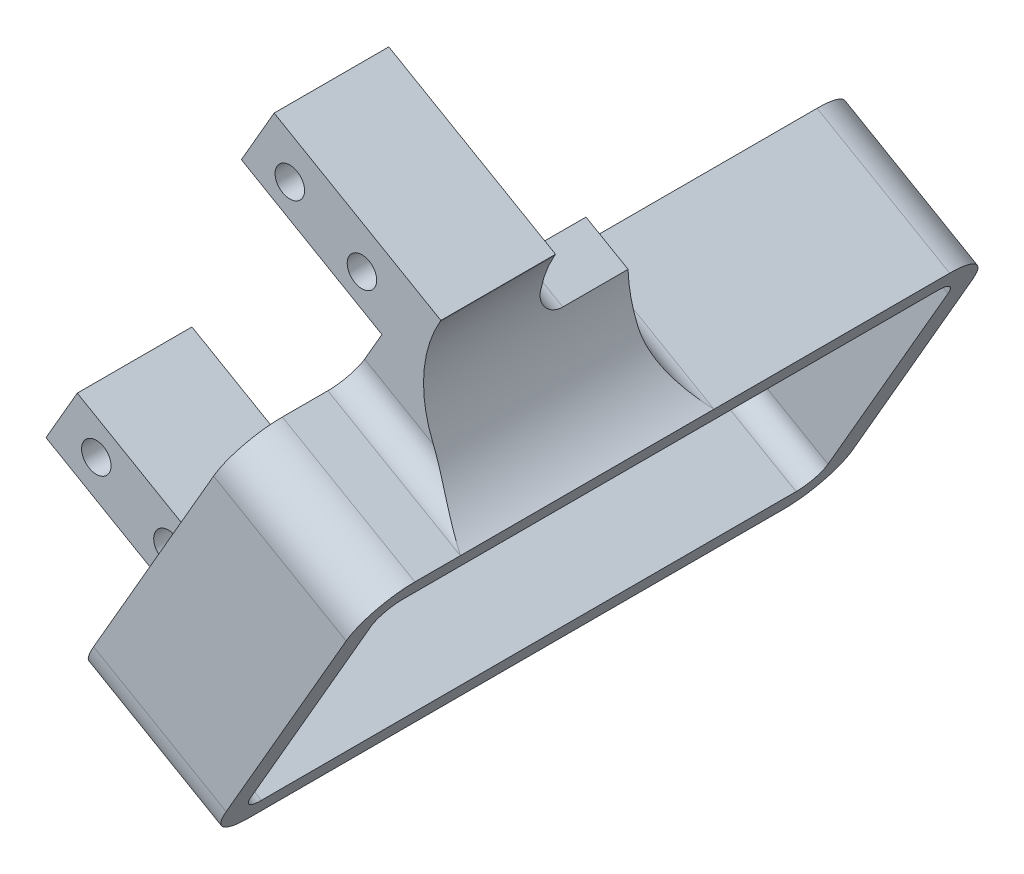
ISO-10303-21;
HEADER;
FILE_DESCRIPTION(('STEP AP214'),'2;1');
FILE_NAME('part.step','',(''),(''),'','','');
FILE_SCHEMA(('AUTOMOTIVE_DESIGN { 1 0 10303 214 1 1 1 1 }'));
ENDSEC;
DATA;
#1=APPLICATION_CONTEXT('core data for automotive mechanical design processes');
#2=APPLICATION_PROTOCOL_DEFINITION('international standard','automotive_design',2000,#1);
#3=PRODUCT_CONTEXT('',#1,'mechanical');
#4=PRODUCT('Part','Part','',(#3));
#5=PRODUCT_RELATED_PRODUCT_CATEGORY('part','',(#4));
#6=PRODUCT_DEFINITION_FORMATION('','',#4);
#7=PRODUCT_DEFINITION_CONTEXT('part definition',#1,'design');
#8=PRODUCT_DEFINITION('design','',#6,#7);
#9=PRODUCT_DEFINITION_SHAPE('','',#8);
#10=(LENGTH_UNIT() NAMED_UNIT(*) SI_UNIT(.MILLI.,.METRE.));
#11=(NAMED_UNIT(*) PLANE_ANGLE_UNIT() SI_UNIT($,.RADIAN.));
#12=(NAMED_UNIT(*) SI_UNIT($,.STERADIAN.) SOLID_ANGLE_UNIT());
#13=UNCERTAINTY_MEASURE_WITH_UNIT(LENGTH_MEASURE(1.E-05),#10,'distance_accuracy_value','');
#14=(GEOMETRIC_REPRESENTATION_CONTEXT(3) GLOBAL_UNCERTAINTY_ASSIGNED_CONTEXT((#13)) GLOBAL_UNIT_ASSIGNED_CONTEXT((#10,
#11,#12)) REPRESENTATION_CONTEXT('',''));
#15=CARTESIAN_POINT('',(0.,0.,0.));
#16=DIRECTION('',(0.,0.,1.));
#17=DIRECTION('',(1.,0.,0.));
#18=AXIS2_PLACEMENT_3D('',#15,#16,#17);
#19=CARTESIAN_POINT('',(47.4570657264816,14.8280490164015,-45.7499999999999));
#20=DIRECTION('',(-0.5,-0.866025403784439,0.));
#21=DIRECTION('',(0.866025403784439,-0.5,0.));
#22=AXIS2_PLACEMENT_3D('',#19,#20,#21);
#23=PLANE('',#22);
#24=DIRECTION('',(0.,0.,1.));
#25=VECTOR('',#24,1.);
#26=CARTESIAN_POINT('',(47.4570657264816,14.8280490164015,-45.7499999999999));
#27=LINE('',#26,#25);
#28=CARTESIAN_POINT('',(47.4570657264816,14.8280490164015,13.9999999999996));
#29=VERTEX_POINT('',#28);
#30=CARTESIAN_POINT('',(47.4570657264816,14.8280490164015,19.55));
#31=VERTEX_POINT('',#30);
#32=EDGE_CURVE('E511',#29,#31,#27,.T.);
#33=ORIENTED_EDGE('',*,*,#32,.F.);
#34=DIRECTION('',(0.866025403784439,-0.5,0.));
#35=VECTOR('',#34,1.);
#36=CARTESIAN_POINT('',(47.4570657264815,14.8280490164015,13.9999999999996));
#37=LINE('',#36,#35);
#38=CARTESIAN_POINT('',(31.2710509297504,24.1730490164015,13.9999999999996));
#39=VERTEX_POINT('',#38);
#40=EDGE_CURVE('E796',#29,#39,#37,.F.);
#41=ORIENTED_EDGE('',*,*,#40,.T.);
#42=DIRECTION('',(0.,0.,1.));
#43=VECTOR('',#42,1.);
#44=CARTESIAN_POINT('',(31.2710509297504,24.1730490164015,-13.9700000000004));
#45=LINE('',#44,#43);
#46=CARTESIAN_POINT('',(31.2710509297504,24.1730490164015,19.55));
#47=VERTEX_POINT('',#46);
#48=EDGE_CURVE('E900',#39,#47,#45,.T.);
#49=ORIENTED_EDGE('',*,*,#48,.T.);
#50=DIRECTION('',(-0.866025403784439,0.5,0.));
#51=VECTOR('',#50,1.);
#52=CARTESIAN_POINT('',(47.4570657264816,14.8280490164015,19.55));
#53=LINE('',#52,#51);
#54=EDGE_CURVE('E535',#31,#47,#53,.T.);
#55=ORIENTED_EDGE('',*,*,#54,.F.);
#56=EDGE_LOOP('',(#33,#41,#49,#55));
#57=FACE_BOUND('',#56,.T.);
#58=ADVANCED_FACE('F30',(#57),#23,.F.);
#59=CARTESIAN_POINT('',(8.80747835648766,-5.08500000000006,-3.0000000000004));
#60=DIRECTION('',(0.,0.,-1.));
#61=DIRECTION('',(-0.907876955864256,0.419236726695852,0.));
#62=AXIS2_PLACEMENT_3D('',#59,#60,#61);
#63=PLANE('',#62);
#64=DIRECTION('',(-0.866025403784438,-0.500000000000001,0.));
#65=VECTOR('',#64,1.);
#66=CARTESIAN_POINT('',(5.55111512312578E-13,3.23893501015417,-3.00000000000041));
#67=LINE('',#66,#65);
#68=CARTESIAN_POINT('',(5.55111512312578E-13,3.23893501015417,-3.00000000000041));
#69=VERTEX_POINT('',#68);
#70=CARTESIAN_POINT('',(-2.80499999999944,1.61946750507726,-3.00000000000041));
#71=VERTEX_POINT('',#70);
#72=EDGE_CURVE('E547',#69,#71,#67,.T.);
#73=ORIENTED_EDGE('',*,*,#72,.T.);
#74=DIRECTION('',(0.,-1.,0.));
#75=VECTOR('',#74,1.);
#76=CARTESIAN_POINT('',(-2.80499999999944,1.61946750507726,-3.00000000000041));
#77=LINE('',#76,#75);
#78=CARTESIAN_POINT('',(-2.80499999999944,-1.61946750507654,-3.0000000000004));
#79=VERTEX_POINT('',#78);
#80=EDGE_CURVE('E550',#71,#79,#77,.T.);
#81=ORIENTED_EDGE('',*,*,#80,.T.);
#82=DIRECTION('',(0.866025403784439,-0.5,0.));
#83=VECTOR('',#82,1.);
#84=CARTESIAN_POINT('',(-2.80499999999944,-1.61946750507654,-3.00000000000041));
#85=LINE('',#84,#83);
#86=CARTESIAN_POINT('',(5.55111512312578E-13,-3.23893501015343,-3.00000000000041));
#87=VERTEX_POINT('',#86);
#88=EDGE_CURVE('E554',#79,#87,#85,.T.);
#89=ORIENTED_EDGE('',*,*,#88,.T.);
#90=DIRECTION('',(0.866025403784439,0.5,0.));
#91=VECTOR('',#90,1.);
#92=CARTESIAN_POINT('',(5.55111512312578E-13,-3.23893501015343,-3.00000000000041));
#93=LINE('',#92,#91);
#94=CARTESIAN_POINT('',(2.80500000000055,-1.61946750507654,-3.00000000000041));
#95=VERTEX_POINT('',#94);
#96=EDGE_CURVE('E557',#87,#95,#93,.T.);
#97=ORIENTED_EDGE('',*,*,#96,.T.);
#98=DIRECTION('',(0.,1.,0.));
#99=VECTOR('',#98,1.);
#100=CARTESIAN_POINT('',(2.80500000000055,-1.61946750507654,-3.00000000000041));
#101=LINE('',#100,#99);
#102=CARTESIAN_POINT('',(2.80500000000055,1.61946750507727,-3.00000000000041));
#103=VERTEX_POINT('',#102);
#104=EDGE_CURVE('E560',#95,#103,#101,.T.);
#105=ORIENTED_EDGE('',*,*,#104,.T.);
#106=DIRECTION('',(-0.866025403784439,0.5,0.));
#107=VECTOR('',#106,1.);
#108=CARTESIAN_POINT('',(2.80500000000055,1.61946750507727,-3.00000000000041));
#109=LINE('',#108,#107);
#110=EDGE_CURVE('E563',#103,#69,#109,.T.);
#111=ORIENTED_EDGE('',*,*,#110,.T.);
#112=EDGE_LOOP('',(#73,#81,#89,#97,#105,#111));
#113=FACE_BOUND('',#112,.T.);
#114=DIRECTION('',(-0.866025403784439,0.499999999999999,0.));
#115=VECTOR('',#114,1.);
#116=CARTESIAN_POINT('',(-2.32357257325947,5.62545424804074,-3.00000000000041));
#117=LINE('',#116,#115);
#118=CARTESIAN_POINT('',(12.2429747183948,-2.78454575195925,-3.00000000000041));
#119=VERTEX_POINT('',#118);
#120=CARTESIAN_POINT('',(-2.32357257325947,5.62545424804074,-3.00000000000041));
#121=VERTEX_POINT('',#120);
#122=EDGE_CURVE('E737',#119,#121,#117,.T.);
#123=ORIENTED_EDGE('',*,*,#122,.F.);
#124=DIRECTION('',(-0.499999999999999,-0.866025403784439,0.));
#125=VECTOR('',#124,1.);
#126=CARTESIAN_POINT('',(10.3879747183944,-5.99750000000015,-3.0000000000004));
#127=LINE('',#126,#125);
#128=CARTESIAN_POINT('',(11.6124783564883,-3.87659748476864,-3.0000000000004));
#129=VERTEX_POINT('',#128);
#130=EDGE_CURVE('E786',#119,#129,#127,.T.);
#131=ORIENTED_EDGE('',*,*,#130,.T.);
#132=DIRECTION('',(0.,1.,0.));
#133=VECTOR('',#132,1.);
#134=CARTESIAN_POINT('',(11.6124783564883,-6.70446750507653,-3.00000000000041));
#135=LINE('',#134,#133);
#136=CARTESIAN_POINT('',(11.6124783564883,-3.46553249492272,-3.00000000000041));
#137=VERTEX_POINT('',#136);
#138=EDGE_CURVE('E608',#129,#137,#135,.T.);
#139=ORIENTED_EDGE('',*,*,#138,.T.);
#140=DIRECTION('',(-0.866025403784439,0.5,0.));
#141=VECTOR('',#140,1.);
#142=CARTESIAN_POINT('',(11.6124783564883,-3.46553249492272,-3.00000000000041));
#143=LINE('',#142,#141);
#144=CARTESIAN_POINT('',(8.80747835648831,-1.84606498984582,-3.00000000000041));
#145=VERTEX_POINT('',#144);
#146=EDGE_CURVE('E610',#137,#145,#143,.T.);
#147=ORIENTED_EDGE('',*,*,#146,.T.);
#148=DIRECTION('',(-0.866025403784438,-0.500000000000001,0.));
#149=VECTOR('',#148,1.);
#150=CARTESIAN_POINT('',(8.80747835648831,-1.84606498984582,-3.00000000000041));
#151=LINE('',#150,#149);
#152=CARTESIAN_POINT('',(6.00247835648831,-3.46553249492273,-3.00000000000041));
#153=VERTEX_POINT('',#152);
#154=EDGE_CURVE('E595',#145,#153,#151,.T.);
#155=ORIENTED_EDGE('',*,*,#154,.T.);
#156=DIRECTION('',(0.,-1.,0.));
#157=VECTOR('',#156,1.);
#158=CARTESIAN_POINT('',(6.00247835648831,-3.46553249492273,-3.00000000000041));
#159=LINE('',#158,#157);
#160=CARTESIAN_POINT('',(6.00247835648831,-6.70446750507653,-3.0000000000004));
#161=VERTEX_POINT('',#160);
#162=EDGE_CURVE('E598',#153,#161,#159,.T.);
#163=ORIENTED_EDGE('',*,*,#162,.T.);
#164=DIRECTION('',(0.866025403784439,-0.5,0.));
#165=VECTOR('',#164,1.);
#166=CARTESIAN_POINT('',(6.00247835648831,-6.70446750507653,-3.00000000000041));
#167=LINE('',#166,#165);
#168=CARTESIAN_POINT('',(8.80747835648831,-8.32393501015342,-3.00000000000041));
#169=VERTEX_POINT('',#168);
#170=EDGE_CURVE('E602',#161,#169,#167,.T.);
#171=ORIENTED_EDGE('',*,*,#170,.T.);
#172=DIRECTION('',(0.866025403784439,0.5,0.));
#173=VECTOR('',#172,1.);
#174=CARTESIAN_POINT('',(8.80747835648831,-8.32393501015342,-3.00000000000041));
#175=LINE('',#174,#173);
#176=CARTESIAN_POINT('',(9.16347108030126,-8.11840251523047,-3.0000000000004));
#177=VERTEX_POINT('',#176);
#178=EDGE_CURVE('E605',#169,#177,#175,.T.);
#179=ORIENTED_EDGE('',*,*,#178,.T.);
#180=DIRECTION('',(-0.499999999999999,-0.866025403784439,0.));
#181=VECTOR('',#180,1.);
#182=CARTESIAN_POINT('',(10.3879747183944,-5.99750000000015,-3.0000000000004));
#183=LINE('',#182,#181);
#184=CARTESIAN_POINT('',(8.4229747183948,-9.40097983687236,-3.00000000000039));
#185=VERTEX_POINT('',#184);
#186=EDGE_CURVE('E749',#177,#185,#183,.T.);
#187=ORIENTED_EDGE('',*,*,#186,.T.);
#188=DIRECTION('',(0.866025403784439,-0.5,0.));
#189=VECTOR('',#188,1.);
#190=CARTESIAN_POINT('',(14.2166846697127,-12.7459798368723,-3.00000000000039));
#191=LINE('',#190,#189);
#192=CARTESIAN_POINT('',(-6.1435725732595,-0.99097983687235,-3.00000000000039));
#193=VERTEX_POINT('',#192);
#194=EDGE_CURVE('E720',#193,#185,#191,.T.);
#195=ORIENTED_EDGE('',*,*,#194,.F.);
#196=DIRECTION('',(-0.500000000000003,-0.866025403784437,0.));
#197=VECTOR('',#196,1.);
#198=CARTESIAN_POINT('',(-6.14357257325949,-0.990979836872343,-3.00000000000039));
#199=LINE('',#198,#197);
#200=EDGE_CURVE('E733',#121,#193,#199,.T.);
#201=ORIENTED_EDGE('',*,*,#200,.F.);
#202=EDGE_LOOP('',(#123,#131,#139,#147,#155,#163,#171,#179,#187,#195,#201));
#203=FACE_BOUND('',#202,.T.);
#204=ADVANCED_FACE('F932',(#113,#203),#63,.T.);
#205=CARTESIAN_POINT('',(20.9064274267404,45.8609945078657,10.9999999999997));
#206=DIRECTION('',(0.,0.,1.));
#207=DIRECTION('',(-0.499999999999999,-0.866025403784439,0.));
#208=AXIS2_PLACEMENT_3D('',#205,#206,#207);
#209=PLANE('',#208);
#210=CARTESIAN_POINT('',(32.4374783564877,35.8433605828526,10.9999999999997));
#211=DIRECTION('',(0.,0.,1.));
#212=DIRECTION('',(0.,-1.,0.));
#213=AXIS2_PLACEMENT_3D('',#210,#211,#212);
#214=CIRCLE('',#213,1.79999999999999);
#215=CARTESIAN_POINT('',(32.4374783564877,34.0433605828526,10.9999999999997));
#216=VERTEX_POINT('',#215);
#217=EDGE_CURVE('E1139',#216,#216,#214,.T.);
#218=ORIENTED_EDGE('',*,*,#217,.F.);
#219=EDGE_LOOP('',(#218));
#220=FACE_BOUND('',#219,.T.);
#221=CARTESIAN_POINT('',(23.63,40.9283605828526,10.9999999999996));
#222=DIRECTION('',(0.,0.,1.));
#223=DIRECTION('',(0.,-1.,0.));
#224=AXIS2_PLACEMENT_3D('',#221,#222,#223);
#225=CIRCLE('',#224,1.79999999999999);
#226=CARTESIAN_POINT('',(23.63,39.1283605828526,10.9999999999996));
#227=VERTEX_POINT('',#226);
#228=EDGE_CURVE('E1143',#227,#227,#225,.T.);
#229=ORIENTED_EDGE('',*,*,#228,.F.);
#230=EDGE_LOOP('',(#229));
#231=FACE_BOUND('',#230,.T.);
#232=DIRECTION('',(-0.499999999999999,-0.866025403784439,0.));
#233=VECTOR('',#232,1.);
#234=CARTESIAN_POINT('',(14.8410509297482,-4.28454575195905,10.9999999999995));
#235=LINE('',#234,#233);
#236=CARTESIAN_POINT('',(34.8810509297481,30.4257524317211,10.9999999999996));
#237=VERTEX_POINT('',#236);
#238=CARTESIAN_POINT('',(32.7710509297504,26.7711252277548,10.9999999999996));
#239=VERTEX_POINT('',#238);
#240=EDGE_CURVE('E746',#237,#239,#235,.T.);
#241=ORIENTED_EDGE('',*,*,#240,.T.);
#242=DIRECTION('',(0.866025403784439,-0.5,0.));
#243=VECTOR('',#242,1.);
#244=CARTESIAN_POINT('',(15.6064274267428,36.6811252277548,10.9999999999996));
#245=LINE('',#244,#243);
#246=CARTESIAN_POINT('',(41.1628370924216,21.9261252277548,10.9999999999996));
#247=VERTEX_POINT('',#246);
#248=EDGE_CURVE('E792',#239,#247,#245,.T.);
#249=ORIENTED_EDGE('',*,*,#248,.T.);
#250=CARTESIAN_POINT('',(54.9570657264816,27.8184300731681,10.9999999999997));
#251=DIRECTION('',(0.,0.,1.));
#252=DIRECTION('',(0.,-1.,0.));
#253=AXIS2_PLACEMENT_3D('',#250,#251,#252);
#254=CIRCLE('',#253,15.);
#255=CARTESIAN_POINT('',(41.966684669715,35.3184300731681,10.9999999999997));
#256=VERTEX_POINT('',#255);
#257=EDGE_CURVE('E854',#247,#256,#254,.F.);
#258=ORIENTED_EDGE('',*,*,#257,.T.);
#259=DIRECTION('',(0.5,0.866025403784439,0.));
#260=VECTOR('',#259,1.);
#261=CARTESIAN_POINT('',(14.2166846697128,-12.7459798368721,10.9999999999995));
#262=LINE('',#261,#260);
#263=CARTESIAN_POINT('',(42.0766846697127,35.5089556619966,10.9999999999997));
#264=VERTEX_POINT('',#263);
#265=EDGE_CURVE('E759',#256,#264,#262,.T.);
#266=ORIENTED_EDGE('',*,*,#265,.T.);
#267=DIRECTION('',(-0.86602540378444,0.499999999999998,0.));
#268=VECTOR('',#267,1.);
#269=CARTESIAN_POINT('',(21.7164274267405,47.2639556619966,10.9999999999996));
#270=LINE('',#269,#268);
#271=CARTESIAN_POINT('',(21.7164274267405,47.2639556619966,10.9999999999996));
#272=VERTEX_POINT('',#271);
#273=EDGE_CURVE('E756',#264,#272,#270,.T.);
#274=ORIENTED_EDGE('',*,*,#273,.T.);
#275=DIRECTION('',(-0.499999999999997,-0.86602540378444,0.));
#276=VECTOR('',#275,1.);
#277=CARTESIAN_POINT('',(17.7164274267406,40.3357524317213,10.9999999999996));
#278=LINE('',#277,#276);
#279=CARTESIAN_POINT('',(17.7164274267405,40.3357524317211,10.9999999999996));
#280=VERTEX_POINT('',#279);
#281=EDGE_CURVE('E753',#272,#280,#278,.T.);
#282=ORIENTED_EDGE('',*,*,#281,.T.);
#283=DIRECTION('',(0.866025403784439,-0.499999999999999,0.));
#284=VECTOR('',#283,1.);
#285=CARTESIAN_POINT('',(34.8810509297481,30.4257524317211,10.9999999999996));
#286=LINE('',#285,#284);
#287=EDGE_CURVE('E750',#280,#237,#286,.T.);
#288=ORIENTED_EDGE('',*,*,#287,.T.);
#289=EDGE_LOOP('',(#241,#249,#258,#266,#274,#282,#288));
#290=FACE_BOUND('',#289,.T.);
#291=ADVANCED_FACE('F982',(#220,#231,#290),#209,.T.);
#292=CARTESIAN_POINT('',(8.80747835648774,-5.085,10.9999999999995));
#293=DIRECTION('',(0.,0.,1.));
#294=DIRECTION('',(0.,-1.,0.));
#295=AXIS2_PLACEMENT_3D('',#292,#293,#294);
#296=CIRCLE('',#295,1.79999999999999);
#297=CARTESIAN_POINT('',(8.80747835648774,-6.88499999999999,10.9999999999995));
#298=VERTEX_POINT('',#297);
#299=EDGE_CURVE('E1759',#298,#298,#296,.T.);
#300=ORIENTED_EDGE('',*,*,#299,.F.);
#301=EDGE_LOOP('',(#300));
#302=FACE_BOUND('',#301,.T.);
#303=CARTESIAN_POINT('',(0.,0.,10.9999999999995));
#304=DIRECTION('',(0.,0.,1.));
#305=DIRECTION('',(0.,-1.,0.));
#306=AXIS2_PLACEMENT_3D('',#303,#304,#305);
#307=CIRCLE('',#306,1.79999999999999);
#308=CARTESIAN_POINT('',(0.,-1.79999999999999,10.9999999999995));
#309=VERTEX_POINT('',#308);
#310=EDGE_CURVE('E438',#309,#309,#307,.T.);
#311=ORIENTED_EDGE('',*,*,#310,.F.);
#312=EDGE_LOOP('',(#311));
#313=FACE_BOUND('',#312,.T.);
#314=DIRECTION('',(0.866025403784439,-0.5,0.));
#315=VECTOR('',#314,1.);
#316=CARTESIAN_POINT('',(14.2166846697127,-12.7459798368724,10.9999999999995));
#317=LINE('',#316,#315);
#318=CARTESIAN_POINT('',(-6.14357257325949,-0.990979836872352,10.9999999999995));
#319=VERTEX_POINT('',#318);
#320=CARTESIAN_POINT('',(11.0210509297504,-10.9009798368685,10.9999999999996));
#321=VERTEX_POINT('',#320);
#322=EDGE_CURVE('E761',#319,#321,#317,.T.);
#323=ORIENTED_EDGE('',*,*,#322,.T.);
#324=DIRECTION('',(0.499999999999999,0.866025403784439,0.));
#325=VECTOR('',#324,1.);
#326=CARTESIAN_POINT('',(38.071050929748,35.9509945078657,10.9999999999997));
#327=LINE('',#326,#325);
#328=CARTESIAN_POINT('',(14.8410509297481,-4.28454575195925,10.9999999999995));
#329=VERTEX_POINT('',#328);
#330=EDGE_CURVE('E447',#321,#329,#327,.T.);
#331=ORIENTED_EDGE('',*,*,#330,.T.);
#332=DIRECTION('',(-0.866025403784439,0.499999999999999,0.));
#333=VECTOR('',#332,1.);
#334=CARTESIAN_POINT('',(-2.32357257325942,5.62545424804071,10.9999999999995));
#335=LINE('',#334,#333);
#336=CARTESIAN_POINT('',(-2.32357257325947,5.62545424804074,10.9999999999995));
#337=VERTEX_POINT('',#336);
#338=EDGE_CURVE('E767',#329,#337,#335,.T.);
#339=ORIENTED_EDGE('',*,*,#338,.T.);
#340=DIRECTION('',(-0.500000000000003,-0.866025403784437,0.));
#341=VECTOR('',#340,1.);
#342=CARTESIAN_POINT('',(-6.14357257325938,-0.990979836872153,10.9999999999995));
#343=LINE('',#342,#341);
#344=EDGE_CURVE('E764',#337,#319,#343,.T.);
#345=ORIENTED_EDGE('',*,*,#344,.T.);
#346=EDGE_LOOP('',(#323,#331,#339,#345));
#347=FACE_BOUND('',#346,.T.);
#348=ADVANCED_FACE('F921',(#302,#313,#347),#209,.T.);
#349=CARTESIAN_POINT('',(53.9066019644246,-26.7235821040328,-13.9700000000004));
#350=DIRECTION('',(0.,0.,1.));
#351=DIRECTION('',(0.,-1.,0.));
#352=AXIS2_PLACEMENT_3D('',#349,#350,#351);
#353=PLANE('',#352);
#354=DIRECTION('',(-0.866025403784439,0.499999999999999,0.));
#355=VECTOR('',#354,1.);
#356=CARTESIAN_POINT('',(73.8466019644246,7.8135109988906,-13.9700000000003));
#357=LINE('',#356,#355);
#358=CARTESIAN_POINT('',(39.9635956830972,27.3758737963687,-13.9700000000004));
#359=VERTEX_POINT('',#358);
#360=CARTESIAN_POINT('',(34.8310509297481,30.3391498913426,-13.9700000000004));
#361=VERTEX_POINT('',#360);
#362=EDGE_CURVE('E56',#359,#361,#357,.T.);
#363=ORIENTED_EDGE('',*,*,#362,.F.);
#364=CARTESIAN_POINT('',(54.9570657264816,27.8184300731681,-13.9700000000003));
#365=DIRECTION('',(0.,0.,1.));
#366=DIRECTION('',(0.,-1.,0.));
#367=AXIS2_PLACEMENT_3D('',#364,#365,#366);
#368=CIRCLE('',#367,15.);
#369=CARTESIAN_POINT('',(41.1628370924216,21.9261252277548,-13.9700000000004));
#370=VERTEX_POINT('',#369);
#371=EDGE_CURVE('E43',#359,#370,#368,.T.);
#372=ORIENTED_EDGE('',*,*,#371,.T.);
#373=DIRECTION('',(0.866025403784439,-0.5,0.));
#374=VECTOR('',#373,1.);
#375=CARTESIAN_POINT('',(32.7710509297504,26.7711252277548,-13.9700000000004));
#376=LINE('',#375,#374);
#377=CARTESIAN_POINT('',(32.7710509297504,26.7711252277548,-13.9700000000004));
#378=VERTEX_POINT('',#377);
#379=EDGE_CURVE('E49',#370,#378,#376,.F.);
#380=ORIENTED_EDGE('',*,*,#379,.T.);
#381=DIRECTION('',(0.499999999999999,0.866025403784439,0.));
#382=VECTOR('',#381,1.);
#383=CARTESIAN_POINT('',(14.8910509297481,-4.1979432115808,-13.9700000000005));
#384=LINE('',#383,#382);
#385=EDGE_CURVE('E540',#378,#361,#384,.T.);
#386=ORIENTED_EDGE('',*,*,#385,.T.);
#387=EDGE_LOOP('',(#363,#372,#380,#386));
#388=FACE_BOUND('',#387,.T.);
#389=ADVANCED_FACE('F881',(#388),#353,.F.);
#390=CARTESIAN_POINT('',(14.2166846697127,-12.7459798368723,87.9830212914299));
#391=DIRECTION('',(-0.866025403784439,0.5,0.));
#392=DIRECTION('',(-0.5,-0.866025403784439,0.));
#393=AXIS2_PLACEMENT_3D('',#390,#391,#392);
#394=PLANE('',#393);
#395=ORIENTED_EDGE('',*,*,#265,.F.);
#396=DIRECTION('',(0.,0.,1.));
#397=VECTOR('',#396,1.);
#398=CARTESIAN_POINT('',(41.966684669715,35.3184300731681,-16.9700000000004));
#399=LINE('',#398,#397);
#400=CARTESIAN_POINT('',(41.966684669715,35.3184300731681,-3.0000000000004));
#401=VERTEX_POINT('',#400);
#402=EDGE_CURVE('E845',#256,#401,#399,.F.);
#403=ORIENTED_EDGE('',*,*,#402,.T.);
#404=DIRECTION('',(0.5,0.866025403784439,0.));
#405=VECTOR('',#404,1.);
#406=CARTESIAN_POINT('',(14.2166846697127,-12.7459798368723,-3.00000000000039));
#407=LINE('',#406,#405);
#408=CARTESIAN_POINT('',(42.0766846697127,35.5089556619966,-3.0000000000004));
#409=VERTEX_POINT('',#408);
#410=EDGE_CURVE('E732',#401,#409,#407,.T.);
#411=ORIENTED_EDGE('',*,*,#410,.T.);
#412=DIRECTION('',(0.,0.,-1.));
#413=VECTOR('',#412,1.);
#414=CARTESIAN_POINT('',(42.0766846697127,35.5089556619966,87.9830212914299));
#415=LINE('',#414,#413);
#416=EDGE_CURVE('E773',#264,#409,#415,.T.);
#417=ORIENTED_EDGE('',*,*,#416,.F.);
#418=EDGE_LOOP('',(#395,#403,#411,#417));
#419=FACE_BOUND('',#418,.T.);
#420=ADVANCED_FACE('F1011',(#419),#394,.F.);
#421=ORIENTED_EDGE('',*,*,#410,.F.);
#422=CARTESIAN_POINT('',(54.9570657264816,27.8184300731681,-3.00000000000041));
#423=DIRECTION('',(0.,0.,-1.));
#424=DIRECTION('',(0.,1.,0.));
#425=AXIS2_PLACEMENT_3D('',#422,#423,#424);
#426=CIRCLE('',#425,15.);
#427=CARTESIAN_POINT('',(40.2333692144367,30.6842215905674,-3.0000000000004));
#428=VERTEX_POINT('',#427);
#429=EDGE_CURVE('E878',#401,#428,#426,.F.);
#430=ORIENTED_EDGE('',*,*,#429,.T.);
#431=DIRECTION('',(-0.866025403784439,0.499999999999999,0.));
#432=VECTOR('',#431,1.);
#433=CARTESIAN_POINT('',(32.152478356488,35.349726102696,-3.0000000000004));
#434=LINE('',#433,#432);
#435=CARTESIAN_POINT('',(34.6724783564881,33.8948034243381,-3.0000000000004));
#436=VERTEX_POINT('',#435);
#437=EDGE_CURVE('E803',#428,#436,#434,.T.);
#438=ORIENTED_EDGE('',*,*,#437,.T.);
#439=DIRECTION('',(0.866025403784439,0.5,0.));
#440=VECTOR('',#439,1.);
#441=CARTESIAN_POINT('',(32.4374783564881,32.6044255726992,-3.00000000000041));
#442=LINE('',#441,#440);
#443=CARTESIAN_POINT('',(35.2424783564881,34.2238930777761,-3.00000000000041));
#444=VERTEX_POINT('',#443);
#445=EDGE_CURVE('E696',#436,#444,#442,.T.);
#446=ORIENTED_EDGE('',*,*,#445,.T.);
#447=DIRECTION('',(0.,1.,0.));
#448=VECTOR('',#447,1.);
#449=CARTESIAN_POINT('',(35.2424783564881,34.2238930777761,-3.00000000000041));
#450=LINE('',#449,#448);
#451=CARTESIAN_POINT('',(35.2424783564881,37.4628280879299,-3.00000000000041));
#452=VERTEX_POINT('',#451);
#453=EDGE_CURVE('E698',#444,#452,#450,.T.);
#454=ORIENTED_EDGE('',*,*,#453,.T.);
#455=DIRECTION('',(-0.866025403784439,0.5,0.));
#456=VECTOR('',#455,1.);
#457=CARTESIAN_POINT('',(35.2424783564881,37.4628280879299,-3.00000000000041));
#458=LINE('',#457,#456);
#459=CARTESIAN_POINT('',(32.4374783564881,39.0822955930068,-3.00000000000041));
#460=VERTEX_POINT('',#459);
#461=EDGE_CURVE('E686',#452,#460,#458,.T.);
#462=ORIENTED_EDGE('',*,*,#461,.T.);
#463=DIRECTION('',(-0.866025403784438,-0.500000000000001,0.));
#464=VECTOR('',#463,1.);
#465=CARTESIAN_POINT('',(32.4374783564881,39.0822955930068,-3.00000000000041));
#466=LINE('',#465,#464);
#467=CARTESIAN_POINT('',(29.6324783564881,37.4628280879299,-3.0000000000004));
#468=VERTEX_POINT('',#467);
#469=EDGE_CURVE('E689',#460,#468,#466,.T.);
#470=ORIENTED_EDGE('',*,*,#469,.T.);
#471=DIRECTION('',(0.,-1.,0.));
#472=VECTOR('',#471,1.);
#473=CARTESIAN_POINT('',(29.6324783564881,37.4628280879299,-3.00000000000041));
#474=LINE('',#473,#472);
#475=CARTESIAN_POINT('',(29.6324783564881,36.8046487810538,-3.0000000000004));
#476=VERTEX_POINT('',#475);
#477=EDGE_CURVE('E693',#468,#476,#474,.T.);
#478=ORIENTED_EDGE('',*,*,#477,.T.);
#479=DIRECTION('',(-0.866025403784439,0.499999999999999,0.));
#480=VECTOR('',#479,1.);
#481=CARTESIAN_POINT('',(32.152478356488,35.349726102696,-3.0000000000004));
#482=LINE('',#481,#480);
#483=CARTESIAN_POINT('',(25.8650000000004,38.9798034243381,-3.0000000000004));
#484=VERTEX_POINT('',#483);
#485=EDGE_CURVE('E801',#476,#484,#482,.T.);
#486=ORIENTED_EDGE('',*,*,#485,.T.);
#487=DIRECTION('',(0.866025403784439,0.5,0.));
#488=VECTOR('',#487,1.);
#489=CARTESIAN_POINT('',(23.6300000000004,37.6894255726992,-3.00000000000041));
#490=LINE('',#489,#488);
#491=CARTESIAN_POINT('',(26.4350000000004,39.3088930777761,-3.00000000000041));
#492=VERTEX_POINT('',#491);
#493=EDGE_CURVE('E649',#484,#492,#490,.T.);
#494=ORIENTED_EDGE('',*,*,#493,.T.);
#495=DIRECTION('',(0.,1.,0.));
#496=VECTOR('',#495,1.);
#497=CARTESIAN_POINT('',(26.4350000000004,39.3088930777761,-3.00000000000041));
#498=LINE('',#497,#496);
#499=CARTESIAN_POINT('',(26.4350000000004,42.5478280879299,-3.00000000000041));
#500=VERTEX_POINT('',#499);
#501=EDGE_CURVE('E651',#492,#500,#498,.T.);
#502=ORIENTED_EDGE('',*,*,#501,.T.);
#503=DIRECTION('',(-0.866025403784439,0.5,0.));
#504=VECTOR('',#503,1.);
#505=CARTESIAN_POINT('',(26.4350000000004,42.5478280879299,-3.00000000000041));
#506=LINE('',#505,#504);
#507=CARTESIAN_POINT('',(23.6300000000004,44.1672955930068,-3.00000000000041));
#508=VERTEX_POINT('',#507);
#509=EDGE_CURVE('E654',#500,#508,#506,.T.);
#510=ORIENTED_EDGE('',*,*,#509,.T.);
#511=DIRECTION('',(-0.866025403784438,-0.500000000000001,0.));
#512=VECTOR('',#511,1.);
#513=CARTESIAN_POINT('',(23.6300000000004,44.1672955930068,-3.00000000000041));
#514=LINE('',#513,#512);
#515=CARTESIAN_POINT('',(20.8250000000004,42.5478280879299,-3.00000000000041));
#516=VERTEX_POINT('',#515);
#517=EDGE_CURVE('E642',#508,#516,#514,.T.);
#518=ORIENTED_EDGE('',*,*,#517,.T.);
#519=DIRECTION('',(0.,-1.,0.));
#520=VECTOR('',#519,1.);
#521=CARTESIAN_POINT('',(20.8250000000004,42.5478280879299,-3.00000000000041));
#522=LINE('',#521,#520);
#523=CARTESIAN_POINT('',(20.8250000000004,41.8896487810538,-3.0000000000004));
#524=VERTEX_POINT('',#523);
#525=EDGE_CURVE('E645',#516,#524,#522,.T.);
#526=ORIENTED_EDGE('',*,*,#525,.T.);
#527=DIRECTION('',(-0.866025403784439,0.499999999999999,0.));
#528=VECTOR('',#527,1.);
#529=CARTESIAN_POINT('',(32.152478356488,35.349726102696,-3.0000000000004));
#530=LINE('',#529,#528);
#531=CARTESIAN_POINT('',(19.1664274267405,42.8472261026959,-3.00000000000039));
#532=VERTEX_POINT('',#531);
#533=EDGE_CURVE('E799',#524,#532,#530,.T.);
#534=ORIENTED_EDGE('',*,*,#533,.T.);
#535=DIRECTION('',(-0.499999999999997,-0.86602540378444,0.));
#536=VECTOR('',#535,1.);
#537=CARTESIAN_POINT('',(17.7164274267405,40.3357524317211,-3.00000000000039));
#538=LINE('',#537,#536);
#539=CARTESIAN_POINT('',(21.7164274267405,47.2639556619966,-3.00000000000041));
#540=VERTEX_POINT('',#539);
#541=EDGE_CURVE('E739',#540,#532,#538,.T.);
#542=ORIENTED_EDGE('',*,*,#541,.F.);
#543=DIRECTION('',(-0.86602540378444,0.499999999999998,0.));
#544=VECTOR('',#543,1.);
#545=CARTESIAN_POINT('',(21.7164274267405,47.2639556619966,-3.00000000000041));
#546=LINE('',#545,#544);
#547=EDGE_CURVE('E742',#409,#540,#546,.T.);
#548=ORIENTED_EDGE('',*,*,#547,.F.);
#549=EDGE_LOOP('',(#421,#430,#438,#446,#454,#462,#470,#478,#486,#494,#502,#510,#518,#526,#534,
#542,#548));
#550=FACE_BOUND('',#549,.T.);
#551=ADVANCED_FACE('F985',(#550),#63,.T.);
#552=CARTESIAN_POINT('',(-6.14357257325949,-0.990979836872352,87.9830212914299));
#553=DIRECTION('',(0.866025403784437,-0.500000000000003,0.));
#554=DIRECTION('',(0.500000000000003,0.866025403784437,0.));
#555=AXIS2_PLACEMENT_3D('',#552,#553,#554);
#556=PLANE('',#555);
#557=ORIENTED_EDGE('',*,*,#344,.F.);
#558=DIRECTION('',(0.,0.,-1.));
#559=VECTOR('',#558,1.);
#560=CARTESIAN_POINT('',(-2.32357257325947,5.62545424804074,87.9830212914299));
#561=LINE('',#560,#559);
#562=EDGE_CURVE('E736',#337,#121,#561,.T.);
#563=ORIENTED_EDGE('',*,*,#562,.T.);
#564=ORIENTED_EDGE('',*,*,#200,.T.);
#565=DIRECTION('',(0.,0.,-1.));
#566=VECTOR('',#565,1.);
#567=CARTESIAN_POINT('',(-6.14357257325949,-0.990979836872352,87.9830212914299));
#568=LINE('',#567,#566);
#569=EDGE_CURVE('E771',#319,#193,#568,.T.);
#570=ORIENTED_EDGE('',*,*,#569,.F.);
#571=EDGE_LOOP('',(#557,#563,#564,#570));
#572=FACE_BOUND('',#571,.T.);
#573=ADVANCED_FACE('F926',(#572),#556,.F.);
#574=CARTESIAN_POINT('',(14.2166846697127,-12.7459798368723,87.9830212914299));
#575=DIRECTION('',(0.5,0.866025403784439,0.));
#576=DIRECTION('',(-0.866025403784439,0.5,0.));
#577=AXIS2_PLACEMENT_3D('',#574,#575,#576);
#578=PLANE('',#577);
#579=ORIENTED_EDGE('',*,*,#194,.T.);
#580=CARTESIAN_POINT('',(8.4229747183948,-9.40097983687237,-6.0000000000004));
#581=DIRECTION('',(0.5,0.866025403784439,0.));
#582=DIRECTION('',(-0.866025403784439,0.5,0.));
#583=AXIS2_PLACEMENT_3D('',#580,#581,#582);
#584=CIRCLE('',#583,3.);
#585=CARTESIAN_POINT('',(11.0210509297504,-10.9009798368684,-6.0000000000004));
#586=VERTEX_POINT('',#585);
#587=EDGE_CURVE('E813',#185,#586,#584,.T.);
#588=ORIENTED_EDGE('',*,*,#587,.T.);
#589=DIRECTION('',(0.,0.,-1.));
#590=VECTOR('',#589,1.);
#591=CARTESIAN_POINT('',(11.0210509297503,-10.9009798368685,19.5499999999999));
#592=LINE('',#591,#590);
#593=CARTESIAN_POINT('',(11.0210509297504,-10.9009798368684,-45.75));
#594=VERTEX_POINT('',#593);
#595=EDGE_CURVE('E910',#586,#594,#592,.T.);
#596=ORIENTED_EDGE('',*,*,#595,.T.);
#597=DIRECTION('',(-0.866025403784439,0.5,0.));
#598=VECTOR('',#597,1.);
#599=CARTESIAN_POINT('',(27.2070657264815,-20.2459798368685,-45.75));
#600=LINE('',#599,#598);
#601=CARTESIAN_POINT('',(27.2070657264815,-20.2459798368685,-45.75));
#602=VERTEX_POINT('',#601);
#603=EDGE_CURVE('E422',#602,#594,#600,.T.);
#604=ORIENTED_EDGE('',*,*,#603,.F.);
#605=DIRECTION('',(0.,0.,-1.));
#606=VECTOR('',#605,1.);
#607=CARTESIAN_POINT('',(27.2070657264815,-20.2459798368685,19.5499999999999));
#608=LINE('',#607,#606);
#609=CARTESIAN_POINT('',(27.2070657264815,-20.2459798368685,19.5499999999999));
#610=VERTEX_POINT('',#609);
#611=EDGE_CURVE('E522',#610,#602,#608,.T.);
#612=ORIENTED_EDGE('',*,*,#611,.F.);
#613=DIRECTION('',(-0.866025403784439,0.5,0.));
#614=VECTOR('',#613,1.);
#615=CARTESIAN_POINT('',(27.2070657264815,-20.2459798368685,19.5499999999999));
#616=LINE('',#615,#614);
#617=CARTESIAN_POINT('',(11.0210509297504,-10.9009798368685,19.5499999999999));
#618=VERTEX_POINT('',#617);
#619=EDGE_CURVE('E529',#610,#618,#616,.T.);
#620=ORIENTED_EDGE('',*,*,#619,.T.);
#621=EDGE_CURVE('E445',#618,#321,#592,.T.);
#622=ORIENTED_EDGE('',*,*,#621,.T.);
#623=ORIENTED_EDGE('',*,*,#322,.F.);
#624=ORIENTED_EDGE('',*,*,#569,.T.);
#625=EDGE_LOOP('',(#579,#588,#596,#604,#612,#620,#622,#623,#624));
#626=FACE_BOUND('',#625,.T.);
#627=ADVANCED_FACE('F917',(#626),#578,.F.);
#628=DIRECTION('',(0.,0.,-1.));
#629=VECTOR('',#628,1.);
#630=CARTESIAN_POINT('',(15.7166846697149,-10.1479036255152,19.5499999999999));
#631=LINE('',#630,#629);
#632=CARTESIAN_POINT('',(15.7166846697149,-10.1479036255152,19.5499999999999));
#633=VERTEX_POINT('',#632);
#634=CARTESIAN_POINT('',(15.716684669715,-10.147903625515,-45.75));
#635=VERTEX_POINT('',#634);
#636=EDGE_CURVE('E453',#633,#635,#631,.T.);
#637=ORIENTED_EDGE('',*,*,#636,.T.);
#638=CARTESIAN_POINT('',(17.016684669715,-7.89623757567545,-45.75));
#639=DIRECTION('',(0.866025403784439,-0.5,0.));
#640=DIRECTION('',(0.5,0.866025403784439,0.));
#641=AXIS2_PLACEMENT_3D('',#638,#639,#640);
#642=CIRCLE('',#641,2.6);
#643=CARTESIAN_POINT('',(17.016684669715,-7.89623757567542,-48.35));
#644=VERTEX_POINT('',#643);
#645=EDGE_CURVE('E449',#635,#644,#642,.T.);
#646=ORIENTED_EDGE('',*,*,#645,.T.);
#647=DIRECTION('',(0.5,0.866025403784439,0.));
#648=VECTOR('',#647,1.);
#649=CARTESIAN_POINT('',(17.016684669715,-7.89623757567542,-48.35));
#650=LINE('',#649,#648);
#651=CARTESIAN_POINT('',(31.666684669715,17.4783067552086,-48.35));
#652=VERTEX_POINT('',#651);
#653=EDGE_CURVE('E471',#644,#652,#650,.T.);
#654=ORIENTED_EDGE('',*,*,#653,.T.);
#655=CARTESIAN_POINT('',(31.666684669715,17.4783067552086,-45.75));
#656=DIRECTION('',(0.866025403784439,-0.5,0.));
#657=DIRECTION('',(0.5,0.866025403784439,0.));
#658=AXIS2_PLACEMENT_3D('',#655,#656,#657);
#659=CIRCLE('',#658,2.6);
#660=CARTESIAN_POINT('',(32.966684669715,19.7299728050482,-45.7499999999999));
#661=VERTEX_POINT('',#660);
#662=EDGE_CURVE('E474',#652,#661,#659,.T.);
#663=ORIENTED_EDGE('',*,*,#662,.T.);
#664=DIRECTION('',(0.,0.,1.));
#665=VECTOR('',#664,1.);
#666=CARTESIAN_POINT('',(32.966684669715,19.7299728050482,-45.7499999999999));
#667=LINE('',#666,#665);
#668=CARTESIAN_POINT('',(32.9666846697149,19.729972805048,19.55));
#669=VERTEX_POINT('',#668);
#670=EDGE_CURVE('E477',#661,#669,#667,.T.);
#671=ORIENTED_EDGE('',*,*,#670,.T.);
#672=CARTESIAN_POINT('',(31.6666846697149,17.4783067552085,19.55));
#673=DIRECTION('',(0.866025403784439,-0.5,0.));
#674=DIRECTION('',(0.5,0.866025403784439,0.));
#675=AXIS2_PLACEMENT_3D('',#672,#673,#674);
#676=CIRCLE('',#675,2.6);
#677=CARTESIAN_POINT('',(31.6666846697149,17.4783067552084,22.15));
#678=VERTEX_POINT('',#677);
#679=EDGE_CURVE('E479',#669,#678,#676,.T.);
#680=ORIENTED_EDGE('',*,*,#679,.T.);
#681=DIRECTION('',(-0.5,-0.866025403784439,0.));
#682=VECTOR('',#681,1.);
#683=CARTESIAN_POINT('',(31.6666846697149,17.4783067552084,22.15));
#684=LINE('',#683,#682);
#685=CARTESIAN_POINT('',(17.0166846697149,-7.8962375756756,22.15));
#686=VERTEX_POINT('',#685);
#687=EDGE_CURVE('E482',#678,#686,#684,.T.);
#688=ORIENTED_EDGE('',*,*,#687,.T.);
#689=CARTESIAN_POINT('',(17.0166846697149,-7.89623757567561,19.55));
#690=DIRECTION('',(0.866025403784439,-0.5,0.));
#691=DIRECTION('',(0.5,0.866025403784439,0.));
#692=AXIS2_PLACEMENT_3D('',#689,#690,#691);
#693=CIRCLE('',#692,2.6);
#694=EDGE_CURVE('E485',#686,#633,#693,.T.);
#695=ORIENTED_EDGE('',*,*,#694,.T.);
#696=EDGE_LOOP('',(#637,#646,#654,#663,#671,#680,#688,#695));
#697=FACE_BOUND('',#696,.T.);
#698=ADVANCED_FACE('F1122',(#697),#394,.F.);
#699=CARTESIAN_POINT('',(21.7164274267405,47.2639556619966,87.9830212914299));
#700=DIRECTION('',(-0.499999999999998,-0.86602540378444,0.));
#701=DIRECTION('',(0.86602540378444,-0.499999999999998,0.));
#702=AXIS2_PLACEMENT_3D('',#699,#700,#701);
#703=PLANE('',#702);
#704=ORIENTED_EDGE('',*,*,#273,.F.);
#705=ORIENTED_EDGE('',*,*,#416,.T.);
#706=ORIENTED_EDGE('',*,*,#547,.T.);
#707=DIRECTION('',(0.,0.,-1.));
#708=VECTOR('',#707,1.);
#709=CARTESIAN_POINT('',(21.7164274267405,47.2639556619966,87.9830212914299));
#710=LINE('',#709,#708);
#711=EDGE_CURVE('E776',#272,#540,#710,.T.);
#712=ORIENTED_EDGE('',*,*,#711,.F.);
#713=EDGE_LOOP('',(#704,#705,#706,#712));
#714=FACE_BOUND('',#713,.T.);
#715=ADVANCED_FACE('F1118',(#714),#703,.F.);
#716=CARTESIAN_POINT('',(17.7164274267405,40.3357524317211,87.9830212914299));
#717=DIRECTION('',(0.86602540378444,-0.499999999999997,0.));
#718=DIRECTION('',(0.499999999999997,0.86602540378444,0.));
#719=AXIS2_PLACEMENT_3D('',#716,#717,#718);
#720=PLANE('',#719);
#721=ORIENTED_EDGE('',*,*,#281,.F.);
#722=ORIENTED_EDGE('',*,*,#711,.T.);
#723=ORIENTED_EDGE('',*,*,#541,.T.);
#724=CARTESIAN_POINT('',(19.1664274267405,42.8472261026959,-6.0000000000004));
#725=DIRECTION('',(0.86602540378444,-0.499999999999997,0.));
#726=DIRECTION('',(0.499999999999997,0.86602540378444,0.));
#727=AXIS2_PLACEMENT_3D('',#724,#725,#726);
#728=CIRCLE('',#727,3.);
#729=CARTESIAN_POINT('',(17.7164274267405,40.3357524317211,-5.23188542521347));
#730=VERTEX_POINT('',#729);
#731=EDGE_CURVE('E837',#532,#730,#728,.T.);
#732=ORIENTED_EDGE('',*,*,#731,.T.);
#733=DIRECTION('',(0.,0.,-1.));
#734=VECTOR('',#733,1.);
#735=CARTESIAN_POINT('',(17.7164274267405,40.3357524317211,87.9830212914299));
#736=LINE('',#735,#734);
#737=EDGE_CURVE('E778',#280,#730,#736,.T.);
#738=ORIENTED_EDGE('',*,*,#737,.F.);
#739=EDGE_LOOP('',(#721,#722,#723,#732,#738));
#740=FACE_BOUND('',#739,.T.);
#741=ADVANCED_FACE('F1114',(#740),#720,.F.);
#742=CARTESIAN_POINT('',(34.8810509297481,30.4257524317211,87.9830212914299));
#743=DIRECTION('',(0.499999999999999,0.866025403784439,0.));
#744=DIRECTION('',(-0.866025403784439,0.499999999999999,0.));
#745=AXIS2_PLACEMENT_3D('',#742,#743,#744);
#746=PLANE('',#745);
#747=ORIENTED_EDGE('',*,*,#287,.F.);
#748=ORIENTED_EDGE('',*,*,#737,.T.);
#749=DIRECTION('',(-0.866025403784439,0.499999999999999,0.));
#750=VECTOR('',#749,1.);
#751=CARTESIAN_POINT('',(17.7164274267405,40.3357524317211,-5.23188542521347));
#752=LINE('',#751,#750);
#753=CARTESIAN_POINT('',(34.8810509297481,30.4257524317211,-5.23188542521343));
#754=VERTEX_POINT('',#753);
#755=EDGE_CURVE('E840',#730,#754,#752,.F.);
#756=ORIENTED_EDGE('',*,*,#755,.T.);
#757=DIRECTION('',(0.,0.,-1.));
#758=VECTOR('',#757,1.);
#759=CARTESIAN_POINT('',(34.8810509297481,30.4257524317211,87.9830212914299));
#760=LINE('',#759,#758);
#761=EDGE_CURVE('E780',#237,#754,#760,.T.);
#762=ORIENTED_EDGE('',*,*,#761,.F.);
#763=EDGE_LOOP('',(#747,#748,#756,#762));
#764=FACE_BOUND('',#763,.T.);
#765=ADVANCED_FACE('F1111',(#764),#746,.F.);
#766=CARTESIAN_POINT('',(14.8410509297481,-4.28454575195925,87.9830212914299));
#767=DIRECTION('',(0.866025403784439,-0.499999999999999,0.));
#768=DIRECTION('',(0.499999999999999,0.866025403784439,0.));
#769=AXIS2_PLACEMENT_3D('',#766,#767,#768);
#770=PLANE('',#769);
#771=ORIENTED_EDGE('',*,*,#595,.F.);
#772=DIRECTION('',(-0.499999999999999,-0.866025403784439,0.));
#773=VECTOR('',#772,1.);
#774=CARTESIAN_POINT('',(14.8410509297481,-4.28454575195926,-6.00000000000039));
#775=LINE('',#774,#773);
#776=CARTESIAN_POINT('',(14.8410509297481,-4.28454575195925,-6.00000000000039));
#777=VERTEX_POINT('',#776);
#778=EDGE_CURVE('E789',#586,#777,#775,.F.);
#779=ORIENTED_EDGE('',*,*,#778,.T.);
#780=DIRECTION('',(0.,0.,-1.));
#781=VECTOR('',#780,1.);
#782=CARTESIAN_POINT('',(14.8410509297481,-4.28454575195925,87.9830212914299));
#783=LINE('',#782,#781);
#784=EDGE_CURVE('E770',#329,#777,#783,.T.);
#785=ORIENTED_EDGE('',*,*,#784,.F.);
#786=ORIENTED_EDGE('',*,*,#330,.F.);
#787=ORIENTED_EDGE('',*,*,#621,.F.);
#788=CARTESIAN_POINT('',(13.8210509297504,-6.05123757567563,19.55));
#789=DIRECTION('',(0.866025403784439,-0.499999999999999,0.));
#790=DIRECTION('',(0.499999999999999,0.866025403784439,0.));
#791=AXIS2_PLACEMENT_3D('',#788,#789,#790);
#792=CIRCLE('',#791,5.60000000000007);
#793=CARTESIAN_POINT('',(13.8210509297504,-6.05123757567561,25.15));
#794=VERTEX_POINT('',#793);
#795=EDGE_CURVE('E908',#794,#618,#792,.T.);
#796=ORIENTED_EDGE('',*,*,#795,.F.);
#797=DIRECTION('',(-0.499999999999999,-0.866025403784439,0.));
#798=VECTOR('',#797,1.);
#799=CARTESIAN_POINT('',(28.4710509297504,19.3233067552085,25.1500000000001));
#800=LINE('',#799,#798);
#801=CARTESIAN_POINT('',(28.4710509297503,19.3233067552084,25.1500000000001));
#802=VERTEX_POINT('',#801);
#803=EDGE_CURVE('E903',#802,#794,#800,.T.);
#804=ORIENTED_EDGE('',*,*,#803,.F.);
#805=CARTESIAN_POINT('',(28.4710509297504,19.3233067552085,19.55));
#806=DIRECTION('',(0.866025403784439,-0.499999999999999,0.));
#807=DIRECTION('',(0.499999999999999,0.866025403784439,0.));
#808=AXIS2_PLACEMENT_3D('',#805,#806,#807);
#809=CIRCLE('',#808,5.60000000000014);
#810=EDGE_CURVE('E899',#47,#802,#809,.T.);
#811=ORIENTED_EDGE('',*,*,#810,.F.);
#812=ORIENTED_EDGE('',*,*,#48,.F.);
#813=CARTESIAN_POINT('',(32.7710509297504,26.7711252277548,13.9999999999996));
#814=DIRECTION('',(0.866025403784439,-0.499999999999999,0.));
#815=DIRECTION('',(0.499999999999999,0.866025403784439,0.));
#816=AXIS2_PLACEMENT_3D('',#813,#814,#815);
#817=CIRCLE('',#816,3.);
#818=EDGE_CURVE('E817',#39,#239,#817,.T.);
#819=ORIENTED_EDGE('',*,*,#818,.T.);
#820=ORIENTED_EDGE('',*,*,#240,.F.);
#821=ORIENTED_EDGE('',*,*,#761,.T.);
#822=CARTESIAN_POINT('',(36.3310509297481,32.9372261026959,-6.0000000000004));
#823=DIRECTION('',(0.866025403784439,-0.499999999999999,0.));
#824=DIRECTION('',(0.499999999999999,0.866025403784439,0.));
#825=AXIS2_PLACEMENT_3D('',#822,#823,#824);
#826=CIRCLE('',#825,3.);
#827=CARTESIAN_POINT('',(34.8310509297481,30.3391498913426,-6.00000000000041));
#828=VERTEX_POINT('',#827);
#829=EDGE_CURVE('E843',#754,#828,#826,.T.);
#830=ORIENTED_EDGE('',*,*,#829,.T.);
#831=DIRECTION('',(0.,0.,1.));
#832=VECTOR('',#831,1.);
#833=CARTESIAN_POINT('',(34.8310509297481,30.3391498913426,-3.00000000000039));
#834=LINE('',#833,#832);
#835=EDGE_CURVE('E542',#361,#828,#834,.T.);
#836=ORIENTED_EDGE('',*,*,#835,.F.);
#837=ORIENTED_EDGE('',*,*,#385,.F.);
#838=CARTESIAN_POINT('',(32.7710509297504,26.7711252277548,-16.9700000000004));
#839=DIRECTION('',(0.866025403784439,-0.499999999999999,0.));
#840=DIRECTION('',(0.499999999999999,0.866025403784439,0.));
#841=AXIS2_PLACEMENT_3D('',#838,#839,#840);
#842=CIRCLE('',#841,3.);
#843=CARTESIAN_POINT('',(31.2710509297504,24.1730490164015,-16.9700000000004));
#844=VERTEX_POINT('',#843);
#845=EDGE_CURVE('E819',#378,#844,#842,.T.);
#846=ORIENTED_EDGE('',*,*,#845,.T.);
#847=CARTESIAN_POINT('',(31.2710509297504,24.1730490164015,-45.7499999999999));
#848=VERTEX_POINT('',#847);
#849=EDGE_CURVE('E898',#848,#844,#45,.T.);
#850=ORIENTED_EDGE('',*,*,#849,.F.);
#851=CARTESIAN_POINT('',(28.4710509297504,19.3233067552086,-45.75));
#852=DIRECTION('',(0.866025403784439,-0.499999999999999,0.));
#853=DIRECTION('',(0.499999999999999,0.866025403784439,0.));
#854=AXIS2_PLACEMENT_3D('',#851,#852,#853);
#855=CIRCLE('',#854,5.60000000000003);
#856=CARTESIAN_POINT('',(28.4710509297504,19.3233067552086,-51.35));
#857=VERTEX_POINT('',#856);
#858=EDGE_CURVE('E433',#857,#848,#855,.T.);
#859=ORIENTED_EDGE('',*,*,#858,.F.);
#860=DIRECTION('',(0.499999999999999,0.866025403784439,0.));
#861=VECTOR('',#860,1.);
#862=CARTESIAN_POINT('',(28.4710509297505,19.3233067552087,-51.35));
#863=LINE('',#862,#861);
#864=CARTESIAN_POINT('',(13.8210509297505,-6.05123757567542,-51.3500000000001));
#865=VERTEX_POINT('',#864);
#866=EDGE_CURVE('E417',#865,#857,#863,.T.);
#867=ORIENTED_EDGE('',*,*,#866,.F.);
#868=CARTESIAN_POINT('',(13.8210509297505,-6.05123757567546,-45.75));
#869=DIRECTION('',(0.866025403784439,-0.499999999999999,0.));
#870=DIRECTION('',(0.499999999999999,0.866025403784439,0.));
#871=AXIS2_PLACEMENT_3D('',#868,#869,#870);
#872=CIRCLE('',#871,5.60000000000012);
#873=EDGE_CURVE('E430',#594,#865,#872,.T.);
#874=ORIENTED_EDGE('',*,*,#873,.F.);
#875=EDGE_LOOP('',(#771,#779,#785,#786,#787,#796,#804,#811,#812,#819,#820,#821,#830,#836,#837,
#846,#850,#859,#867,#874));
#876=FACE_BOUND('',#875,.T.);
#877=ADVANCED_FACE('F429',(#876),#770,.F.);
#878=CARTESIAN_POINT('',(-2.32357257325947,5.62545424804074,87.9830212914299));
#879=DIRECTION('',(-0.499999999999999,-0.866025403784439,0.));
#880=DIRECTION('',(0.866025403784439,-0.499999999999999,0.));
#881=AXIS2_PLACEMENT_3D('',#878,#879,#880);
#882=PLANE('',#881);
#883=ORIENTED_EDGE('',*,*,#338,.F.);
#884=ORIENTED_EDGE('',*,*,#784,.T.);
#885=CARTESIAN_POINT('',(12.2429747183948,-2.78454575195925,-6.0000000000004));
#886=DIRECTION('',(-0.499999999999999,-0.866025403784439,0.));
#887=DIRECTION('',(0.866025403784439,-0.499999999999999,0.));
#888=AXIS2_PLACEMENT_3D('',#885,#886,#887);
#889=CIRCLE('',#888,3.);
#890=EDGE_CURVE('E815',#777,#119,#889,.T.);
#891=ORIENTED_EDGE('',*,*,#890,.T.);
#892=ORIENTED_EDGE('',*,*,#122,.T.);
#893=ORIENTED_EDGE('',*,*,#562,.F.);
#894=EDGE_LOOP('',(#883,#884,#891,#892,#893));
#895=FACE_BOUND('',#894,.T.);
#896=ADVANCED_FACE('F941',(#895),#882,.F.);
#897=CARTESIAN_POINT('',(35.2424783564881,37.4628280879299,-3.00000000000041));
#898=DIRECTION('',(0.5,0.866025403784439,0.));
#899=DIRECTION('',(-0.866025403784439,0.5,0.));
#900=AXIS2_PLACEMENT_3D('',#897,#898,#899);
#901=PLANE('',#900);
#902=DIRECTION('',(-0.866025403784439,0.5,0.));
#903=VECTOR('',#902,1.);
#904=CARTESIAN_POINT('',(35.2424783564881,37.4628280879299,0.));
#905=LINE('',#904,#903);
#906=CARTESIAN_POINT('',(35.2424783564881,37.4628280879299,0.));
#907=VERTEX_POINT('',#906);
#908=CARTESIAN_POINT('',(32.4374783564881,39.0822955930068,0.));
#909=VERTEX_POINT('',#908);
#910=EDGE_CURVE('E676',#907,#909,#905,.T.);
#911=ORIENTED_EDGE('',*,*,#910,.T.);
#912=DIRECTION('',(0.,0.,1.));
#913=VECTOR('',#912,1.);
#914=CARTESIAN_POINT('',(32.4374783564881,39.0822955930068,-3.00000000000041));
#915=LINE('',#914,#913);
#916=EDGE_CURVE('E701',#460,#909,#915,.T.);
#917=ORIENTED_EDGE('',*,*,#916,.F.);
#918=ORIENTED_EDGE('',*,*,#461,.F.);
#919=DIRECTION('',(0.,0.,1.));
#920=VECTOR('',#919,1.);
#921=CARTESIAN_POINT('',(35.2424783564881,37.4628280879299,-3.00000000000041));
#922=LINE('',#921,#920);
#923=EDGE_CURVE('E718',#452,#907,#922,.T.);
#924=ORIENTED_EDGE('',*,*,#923,.T.);
#925=EDGE_LOOP('',(#911,#917,#918,#924));
#926=FACE_BOUND('',#925,.T.);
#927=ADVANCED_FACE('F1088',(#926),#901,.F.);
#928=CARTESIAN_POINT('',(35.2424783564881,34.2238930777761,-3.00000000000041));
#929=DIRECTION('',(1.,0.,0.));
#930=DIRECTION('',(0.,0.,-1.));
#931=AXIS2_PLACEMENT_3D('',#928,#929,#930);
#932=PLANE('',#931);
#933=DIRECTION('',(0.,1.,0.));
#934=VECTOR('',#933,1.);
#935=CARTESIAN_POINT('',(35.2424783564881,34.2238930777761,0.));
#936=LINE('',#935,#934);
#937=CARTESIAN_POINT('',(35.2424783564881,34.2238930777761,0.));
#938=VERTEX_POINT('',#937);
#939=EDGE_CURVE('E690',#938,#907,#936,.T.);
#940=ORIENTED_EDGE('',*,*,#939,.T.);
#941=ORIENTED_EDGE('',*,*,#923,.F.);
#942=ORIENTED_EDGE('',*,*,#453,.F.);
#943=DIRECTION('',(0.,0.,1.));
#944=VECTOR('',#943,1.);
#945=CARTESIAN_POINT('',(35.2424783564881,34.2238930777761,-3.00000000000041));
#946=LINE('',#945,#944);
#947=EDGE_CURVE('E721',#444,#938,#946,.T.);
#948=ORIENTED_EDGE('',*,*,#947,.T.);
#949=EDGE_LOOP('',(#940,#941,#942,#948));
#950=FACE_BOUND('',#949,.T.);
#951=ADVANCED_FACE('F1084',(#950),#932,.F.);
#952=CARTESIAN_POINT('',(32.4374783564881,32.6044255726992,-3.00000000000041));
#953=DIRECTION('',(0.5,-0.866025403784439,0.));
#954=DIRECTION('',(0.866025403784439,0.5,0.));
#955=AXIS2_PLACEMENT_3D('',#952,#953,#954);
#956=PLANE('',#955);
#957=DIRECTION('',(0.866025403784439,0.5,0.));
#958=VECTOR('',#957,1.);
#959=CARTESIAN_POINT('',(32.4374783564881,32.6044255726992,0.));
#960=LINE('',#959,#958);
#961=CARTESIAN_POINT('',(32.4374783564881,32.6044255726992,0.));
#962=VERTEX_POINT('',#961);
#963=EDGE_CURVE('E713',#962,#938,#960,.T.);
#964=ORIENTED_EDGE('',*,*,#963,.T.);
#965=ORIENTED_EDGE('',*,*,#947,.F.);
#966=ORIENTED_EDGE('',*,*,#445,.F.);
#967=CARTESIAN_POINT('',(34.6724783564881,33.8948034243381,-6.0000000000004));
#968=DIRECTION('',(0.5,-0.866025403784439,0.));
#969=DIRECTION('',(-0.866025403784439,-0.5,0.));
#970=AXIS2_PLACEMENT_3D('',#967,#968,#969);
#971=ELLIPSE('',#970,3.46410161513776,3.);
#972=CARTESIAN_POINT('',(32.4374783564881,32.6044255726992,-3.99880660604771));
#973=VERTEX_POINT('',#972);
#974=EDGE_CURVE('E821',#436,#973,#971,.T.);
#975=ORIENTED_EDGE('',*,*,#974,.T.);
#976=DIRECTION('',(0.,0.,1.));
#977=VECTOR('',#976,1.);
#978=CARTESIAN_POINT('',(32.4374783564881,32.6044255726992,-3.00000000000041));
#979=LINE('',#978,#977);
#980=EDGE_CURVE('E723',#973,#962,#979,.T.);
#981=ORIENTED_EDGE('',*,*,#980,.T.);
#982=EDGE_LOOP('',(#964,#965,#966,#975,#981));
#983=FACE_BOUND('',#982,.T.);
#984=ADVANCED_FACE('F1087',(#983),#956,.F.);
#985=CARTESIAN_POINT('',(29.6324783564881,34.2238930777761,-3.00000000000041));
#986=DIRECTION('',(-0.5,-0.866025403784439,0.));
#987=DIRECTION('',(0.866025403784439,-0.5,0.));
#988=AXIS2_PLACEMENT_3D('',#985,#986,#987);
#989=PLANE('',#988);
#990=DIRECTION('',(0.866025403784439,-0.5,0.));
#991=VECTOR('',#990,1.);
#992=CARTESIAN_POINT('',(29.6324783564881,34.2238930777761,0.));
#993=LINE('',#992,#991);
#994=CARTESIAN_POINT('',(29.6324783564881,34.2238930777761,0.));
#995=VERTEX_POINT('',#994);
#996=EDGE_CURVE('E710',#995,#962,#993,.T.);
#997=ORIENTED_EDGE('',*,*,#996,.T.);
#998=ORIENTED_EDGE('',*,*,#980,.F.);
#999=DIRECTION('',(-0.866025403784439,0.499999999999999,0.));
#1000=VECTOR('',#999,1.);
#1001=CARTESIAN_POINT('',(32.4374783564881,32.6044255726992,-3.99880660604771));
#1002=LINE('',#1001,#1000);
#1003=CARTESIAN_POINT('',(29.6324783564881,34.2238930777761,-3.99880660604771));
#1004=VERTEX_POINT('',#1003);
#1005=EDGE_CURVE('E824',#973,#1004,#1002,.T.);
#1006=ORIENTED_EDGE('',*,*,#1005,.T.);
#1007=DIRECTION('',(0.,0.,1.));
#1008=VECTOR('',#1007,1.);
#1009=CARTESIAN_POINT('',(29.6324783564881,34.2238930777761,-3.00000000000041));
#1010=LINE('',#1009,#1008);
#1011=EDGE_CURVE('E725',#1004,#995,#1010,.T.);
#1012=ORIENTED_EDGE('',*,*,#1011,.T.);
#1013=EDGE_LOOP('',(#997,#998,#1006,#1012));
#1014=FACE_BOUND('',#1013,.T.);
#1015=ADVANCED_FACE('F1092',(#1014),#989,.F.);
#1016=CARTESIAN_POINT('',(29.6324783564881,37.4628280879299,-3.00000000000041));
#1017=DIRECTION('',(-1.,0.,0.));
#1018=DIRECTION('',(0.,0.,1.));
#1019=AXIS2_PLACEMENT_3D('',#1016,#1017,#1018);
#1020=PLANE('',#1019);
#1021=DIRECTION('',(0.,-1.,0.));
#1022=VECTOR('',#1021,1.);
#1023=CARTESIAN_POINT('',(29.6324783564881,37.4628280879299,0.));
#1024=LINE('',#1023,#1022);
#1025=CARTESIAN_POINT('',(29.6324783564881,37.4628280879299,0.));
#1026=VERTEX_POINT('',#1025);
#1027=EDGE_CURVE('E707',#1026,#995,#1024,.T.);
#1028=ORIENTED_EDGE('',*,*,#1027,.T.);
#1029=ORIENTED_EDGE('',*,*,#1011,.F.);
#1030=CARTESIAN_POINT('',(29.6324783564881,36.8046487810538,-6.0000000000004));
#1031=DIRECTION('',(-1.,0.,0.));
#1032=DIRECTION('',(0.,1.,0.));
#1033=AXIS2_PLACEMENT_3D('',#1030,#1031,#1032);
#1034=ELLIPSE('',#1033,3.46410161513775,3.);
#1035=EDGE_CURVE('E827',#1004,#476,#1034,.T.);
#1036=ORIENTED_EDGE('',*,*,#1035,.T.);
#1037=ORIENTED_EDGE('',*,*,#477,.F.);
#1038=DIRECTION('',(0.,0.,1.));
#1039=VECTOR('',#1038,1.);
#1040=CARTESIAN_POINT('',(29.6324783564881,37.4628280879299,-3.00000000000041));
#1041=LINE('',#1040,#1039);
#1042=EDGE_CURVE('E727',#468,#1026,#1041,.T.);
#1043=ORIENTED_EDGE('',*,*,#1042,.T.);
#1044=EDGE_LOOP('',(#1028,#1029,#1036,#1037,#1043));
#1045=FACE_BOUND('',#1044,.T.);
#1046=ADVANCED_FACE('F1096',(#1045),#1020,.F.);
#1047=CARTESIAN_POINT('',(32.4374783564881,39.0822955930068,-3.00000000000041));
#1048=DIRECTION('',(-0.500000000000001,0.866025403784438,0.));
#1049=DIRECTION('',(-0.866025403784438,-0.500000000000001,0.));
#1050=AXIS2_PLACEMENT_3D('',#1047,#1048,#1049);
#1051=PLANE('',#1050);
#1052=DIRECTION('',(-0.866025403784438,-0.500000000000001,0.));
#1053=VECTOR('',#1052,1.);
#1054=CARTESIAN_POINT('',(32.4374783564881,39.0822955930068,0.));
#1055=LINE('',#1054,#1053);
#1056=EDGE_CURVE('E704',#909,#1026,#1055,.T.);
#1057=ORIENTED_EDGE('',*,*,#1056,.T.);
#1058=ORIENTED_EDGE('',*,*,#1042,.F.);
#1059=ORIENTED_EDGE('',*,*,#469,.F.);
#1060=ORIENTED_EDGE('',*,*,#916,.T.);
#1061=EDGE_LOOP('',(#1057,#1058,#1059,#1060));
#1062=FACE_BOUND('',#1061,.T.);
#1063=ADVANCED_FACE('F1082',(#1062),#1051,.F.);
#1064=CARTESIAN_POINT('',(32.4374783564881,39.0822955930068,0.));
#1065=DIRECTION('',(0.,0.,1.));
#1066=DIRECTION('',(1.,0.,0.));
#1067=AXIS2_PLACEMENT_3D('',#1064,#1065,#1066);
#1068=PLANE('',#1067);
#1069=CARTESIAN_POINT('',(32.4374783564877,35.8433605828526,2.33439592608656E-13));
#1070=DIRECTION('',(0.,0.,-1.));
#1071=DIRECTION('',(-1.,0.,0.));
#1072=AXIS2_PLACEMENT_3D('',#1069,#1070,#1071);
#1073=CIRCLE('',#1072,1.79999999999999);
#1074=CARTESIAN_POINT('',(30.6374783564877,35.8433605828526,2.33439592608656E-13));
#1075=VERTEX_POINT('',#1074);
#1076=EDGE_CURVE('E1766',#1075,#1075,#1073,.T.);
#1077=ORIENTED_EDGE('',*,*,#1076,.F.);
#1078=EDGE_LOOP('',(#1077));
#1079=FACE_BOUND('',#1078,.T.);
#1080=ORIENTED_EDGE('',*,*,#910,.F.);
#1081=ORIENTED_EDGE('',*,*,#939,.F.);
#1082=ORIENTED_EDGE('',*,*,#963,.F.);
#1083=ORIENTED_EDGE('',*,*,#996,.F.);
#1084=ORIENTED_EDGE('',*,*,#1027,.F.);
#1085=ORIENTED_EDGE('',*,*,#1056,.F.);
#1086=EDGE_LOOP('',(#1080,#1081,#1082,#1083,#1084,#1085));
#1087=FACE_BOUND('',#1086,.T.);
#1088=ADVANCED_FACE('F1078',(#1079,#1087),#1068,.F.);
#1089=CARTESIAN_POINT('',(23.6300000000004,44.1672955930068,-3.00000000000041));
#1090=DIRECTION('',(-0.500000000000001,0.866025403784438,0.));
#1091=DIRECTION('',(-0.866025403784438,-0.500000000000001,0.));
#1092=AXIS2_PLACEMENT_3D('',#1089,#1090,#1091);
#1093=PLANE('',#1092);
#1094=DIRECTION('',(-0.866025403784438,-0.500000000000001,0.));
#1095=VECTOR('',#1094,1.);
#1096=CARTESIAN_POINT('',(23.6300000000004,44.1672955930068,0.));
#1097=LINE('',#1096,#1095);
#1098=CARTESIAN_POINT('',(23.6300000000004,44.1672955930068,0.));
#1099=VERTEX_POINT('',#1098);
#1100=CARTESIAN_POINT('',(20.8250000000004,42.5478280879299,0.));
#1101=VERTEX_POINT('',#1100);
#1102=EDGE_CURVE('E632',#1099,#1101,#1097,.T.);
#1103=ORIENTED_EDGE('',*,*,#1102,.T.);
#1104=DIRECTION('',(0.,0.,1.));
#1105=VECTOR('',#1104,1.);
#1106=CARTESIAN_POINT('',(20.8250000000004,42.5478280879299,-3.00000000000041));
#1107=LINE('',#1106,#1105);
#1108=EDGE_CURVE('E657',#516,#1101,#1107,.T.);
#1109=ORIENTED_EDGE('',*,*,#1108,.F.);
#1110=ORIENTED_EDGE('',*,*,#517,.F.);
#1111=DIRECTION('',(0.,0.,1.));
#1112=VECTOR('',#1111,1.);
#1113=CARTESIAN_POINT('',(23.6300000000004,44.1672955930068,-3.00000000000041));
#1114=LINE('',#1113,#1112);
#1115=EDGE_CURVE('E674',#508,#1099,#1114,.T.);
#1116=ORIENTED_EDGE('',*,*,#1115,.T.);
#1117=EDGE_LOOP('',(#1103,#1109,#1110,#1116));
#1118=FACE_BOUND('',#1117,.T.);
#1119=ADVANCED_FACE('F1060',(#1118),#1093,.F.);
#1120=CARTESIAN_POINT('',(26.4350000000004,42.5478280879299,-3.00000000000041));
#1121=DIRECTION('',(0.5,0.866025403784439,0.));
#1122=DIRECTION('',(-0.866025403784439,0.5,0.));
#1123=AXIS2_PLACEMENT_3D('',#1120,#1121,#1122);
#1124=PLANE('',#1123);
#1125=DIRECTION('',(-0.866025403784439,0.5,0.));
#1126=VECTOR('',#1125,1.);
#1127=CARTESIAN_POINT('',(26.4350000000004,42.5478280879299,0.));
#1128=LINE('',#1127,#1126);
#1129=CARTESIAN_POINT('',(26.4350000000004,42.5478280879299,0.));
#1130=VERTEX_POINT('',#1129);
#1131=EDGE_CURVE('E646',#1130,#1099,#1128,.T.);
#1132=ORIENTED_EDGE('',*,*,#1131,.T.);
#1133=ORIENTED_EDGE('',*,*,#1115,.F.);
#1134=ORIENTED_EDGE('',*,*,#509,.F.);
#1135=DIRECTION('',(0.,0.,1.));
#1136=VECTOR('',#1135,1.);
#1137=CARTESIAN_POINT('',(26.4350000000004,42.5478280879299,-3.00000000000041));
#1138=LINE('',#1137,#1136);
#1139=EDGE_CURVE('E677',#500,#1130,#1138,.T.);
#1140=ORIENTED_EDGE('',*,*,#1139,.T.);
#1141=EDGE_LOOP('',(#1132,#1133,#1134,#1140));
#1142=FACE_BOUND('',#1141,.T.);
#1143=ADVANCED_FACE('F1056',(#1142),#1124,.F.);
#1144=CARTESIAN_POINT('',(26.4350000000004,39.3088930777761,-3.00000000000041));
#1145=DIRECTION('',(1.,0.,0.));
#1146=DIRECTION('',(0.,0.,-1.));
#1147=AXIS2_PLACEMENT_3D('',#1144,#1145,#1146);
#1148=PLANE('',#1147);
#1149=DIRECTION('',(0.,1.,0.));
#1150=VECTOR('',#1149,1.);
#1151=CARTESIAN_POINT('',(26.4350000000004,39.3088930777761,0.));
#1152=LINE('',#1151,#1150);
#1153=CARTESIAN_POINT('',(26.4350000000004,39.3088930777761,0.));
#1154=VERTEX_POINT('',#1153);
#1155=EDGE_CURVE('E669',#1154,#1130,#1152,.T.);
#1156=ORIENTED_EDGE('',*,*,#1155,.T.);
#1157=ORIENTED_EDGE('',*,*,#1139,.F.);
#1158=ORIENTED_EDGE('',*,*,#501,.F.);
#1159=DIRECTION('',(0.,0.,1.));
#1160=VECTOR('',#1159,1.);
#1161=CARTESIAN_POINT('',(26.4350000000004,39.3088930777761,-3.00000000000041));
#1162=LINE('',#1161,#1160);
#1163=EDGE_CURVE('E679',#492,#1154,#1162,.T.);
#1164=ORIENTED_EDGE('',*,*,#1163,.T.);
#1165=EDGE_LOOP('',(#1156,#1157,#1158,#1164));
#1166=FACE_BOUND('',#1165,.T.);
#1167=ADVANCED_FACE('F1059',(#1166),#1148,.F.);
#1168=CARTESIAN_POINT('',(23.6300000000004,37.6894255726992,-3.00000000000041));
#1169=DIRECTION('',(0.5,-0.866025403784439,0.));
#1170=DIRECTION('',(0.866025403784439,0.5,0.));
#1171=AXIS2_PLACEMENT_3D('',#1168,#1169,#1170);
#1172=PLANE('',#1171);
#1173=DIRECTION('',(0.866025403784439,0.5,0.));
#1174=VECTOR('',#1173,1.);
#1175=CARTESIAN_POINT('',(23.6300000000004,37.6894255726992,0.));
#1176=LINE('',#1175,#1174);
#1177=CARTESIAN_POINT('',(23.6300000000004,37.6894255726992,0.));
#1178=VERTEX_POINT('',#1177);
#1179=EDGE_CURVE('E666',#1178,#1154,#1176,.T.);
#1180=ORIENTED_EDGE('',*,*,#1179,.T.);
#1181=ORIENTED_EDGE('',*,*,#1163,.F.);
#1182=ORIENTED_EDGE('',*,*,#493,.F.);
#1183=CARTESIAN_POINT('',(25.8650000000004,38.9798034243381,-6.0000000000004));
#1184=DIRECTION('',(0.5,-0.866025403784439,0.));
#1185=DIRECTION('',(-0.866025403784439,-0.5,0.));
#1186=AXIS2_PLACEMENT_3D('',#1183,#1184,#1185);
#1187=ELLIPSE('',#1186,3.46410161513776,3.);
#1188=CARTESIAN_POINT('',(23.6300000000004,37.6894255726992,-3.99880660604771));
#1189=VERTEX_POINT('',#1188);
#1190=EDGE_CURVE('E829',#484,#1189,#1187,.T.);
#1191=ORIENTED_EDGE('',*,*,#1190,.T.);
#1192=DIRECTION('',(0.,0.,1.));
#1193=VECTOR('',#1192,1.);
#1194=CARTESIAN_POINT('',(23.6300000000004,37.6894255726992,-3.00000000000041));
#1195=LINE('',#1194,#1193);
#1196=EDGE_CURVE('E681',#1189,#1178,#1195,.T.);
#1197=ORIENTED_EDGE('',*,*,#1196,.T.);
#1198=EDGE_LOOP('',(#1180,#1181,#1182,#1191,#1197));
#1199=FACE_BOUND('',#1198,.T.);
#1200=ADVANCED_FACE('F1064',(#1199),#1172,.F.);
#1201=CARTESIAN_POINT('',(20.8250000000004,39.3088930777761,-3.00000000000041));
#1202=DIRECTION('',(-0.5,-0.866025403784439,0.));
#1203=DIRECTION('',(0.866025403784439,-0.5,0.));
#1204=AXIS2_PLACEMENT_3D('',#1201,#1202,#1203);
#1205=PLANE('',#1204);
#1206=DIRECTION('',(0.866025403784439,-0.5,0.));
#1207=VECTOR('',#1206,1.);
#1208=CARTESIAN_POINT('',(20.8250000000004,39.3088930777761,0.));
#1209=LINE('',#1208,#1207);
#1210=CARTESIAN_POINT('',(20.8250000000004,39.3088930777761,0.));
#1211=VERTEX_POINT('',#1210);
#1212=EDGE_CURVE('E663',#1211,#1178,#1209,.T.);
#1213=ORIENTED_EDGE('',*,*,#1212,.T.);
#1214=ORIENTED_EDGE('',*,*,#1196,.F.);
#1215=DIRECTION('',(-0.866025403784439,0.499999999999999,0.));
#1216=VECTOR('',#1215,1.);
#1217=CARTESIAN_POINT('',(23.6300000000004,37.6894255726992,-3.99880660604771));
#1218=LINE('',#1217,#1216);
#1219=CARTESIAN_POINT('',(20.8250000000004,39.3088930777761,-3.99880660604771));
#1220=VERTEX_POINT('',#1219);
#1221=EDGE_CURVE('E832',#1189,#1220,#1218,.T.);
#1222=ORIENTED_EDGE('',*,*,#1221,.T.);
#1223=DIRECTION('',(0.,0.,1.));
#1224=VECTOR('',#1223,1.);
#1225=CARTESIAN_POINT('',(20.8250000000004,39.3088930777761,-3.00000000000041));
#1226=LINE('',#1225,#1224);
#1227=EDGE_CURVE('E683',#1220,#1211,#1226,.T.);
#1228=ORIENTED_EDGE('',*,*,#1227,.T.);
#1229=EDGE_LOOP('',(#1213,#1214,#1222,#1228));
#1230=FACE_BOUND('',#1229,.T.);
#1231=ADVANCED_FACE('F1068',(#1230),#1205,.F.);
#1232=CARTESIAN_POINT('',(20.8250000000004,42.5478280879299,-3.00000000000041));
#1233=DIRECTION('',(-1.,0.,0.));
#1234=DIRECTION('',(0.,0.,1.));
#1235=AXIS2_PLACEMENT_3D('',#1232,#1233,#1234);
#1236=PLANE('',#1235);
#1237=DIRECTION('',(0.,-1.,0.));
#1238=VECTOR('',#1237,1.);
#1239=CARTESIAN_POINT('',(20.8250000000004,42.5478280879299,0.));
#1240=LINE('',#1239,#1238);
#1241=EDGE_CURVE('E660',#1101,#1211,#1240,.T.);
#1242=ORIENTED_EDGE('',*,*,#1241,.T.);
#1243=ORIENTED_EDGE('',*,*,#1227,.F.);
#1244=CARTESIAN_POINT('',(20.8250000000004,41.8896487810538,-6.0000000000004));
#1245=DIRECTION('',(-1.,0.,0.));
#1246=DIRECTION('',(0.,1.,0.));
#1247=AXIS2_PLACEMENT_3D('',#1244,#1245,#1246);
#1248=ELLIPSE('',#1247,3.46410161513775,3.);
#1249=EDGE_CURVE('E835',#1220,#524,#1248,.T.);
#1250=ORIENTED_EDGE('',*,*,#1249,.T.);
#1251=ORIENTED_EDGE('',*,*,#525,.F.);
#1252=ORIENTED_EDGE('',*,*,#1108,.T.);
#1253=EDGE_LOOP('',(#1242,#1243,#1250,#1251,#1252));
#1254=FACE_BOUND('',#1253,.T.);
#1255=ADVANCED_FACE('F1051',(#1254),#1236,.F.);
#1256=CARTESIAN_POINT('',(20.8250000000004,42.5478280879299,0.));
#1257=DIRECTION('',(0.,0.,1.));
#1258=DIRECTION('',(1.,0.,0.));
#1259=AXIS2_PLACEMENT_3D('',#1256,#1257,#1258);
#1260=PLANE('',#1259);
#1261=CARTESIAN_POINT('',(23.63,40.9283605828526,2.33701812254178E-13));
#1262=DIRECTION('',(0.,0.,-1.));
#1263=DIRECTION('',(-1.,0.,0.));
#1264=AXIS2_PLACEMENT_3D('',#1261,#1262,#1263);
#1265=CIRCLE('',#1264,1.79999999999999);
#1266=CARTESIAN_POINT('',(21.83,40.9283605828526,2.33701812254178E-13));
#1267=VERTEX_POINT('',#1266);
#1268=EDGE_CURVE('E1754',#1267,#1267,#1265,.T.);
#1269=ORIENTED_EDGE('',*,*,#1268,.F.);
#1270=EDGE_LOOP('',(#1269));
#1271=FACE_BOUND('',#1270,.T.);
#1272=ORIENTED_EDGE('',*,*,#1102,.F.);
#1273=ORIENTED_EDGE('',*,*,#1131,.F.);
#1274=ORIENTED_EDGE('',*,*,#1155,.F.);
#1275=ORIENTED_EDGE('',*,*,#1179,.F.);
#1276=ORIENTED_EDGE('',*,*,#1212,.F.);
#1277=ORIENTED_EDGE('',*,*,#1241,.F.);
#1278=EDGE_LOOP('',(#1272,#1273,#1274,#1275,#1276,#1277));
#1279=FACE_BOUND('',#1278,.T.);
#1280=ADVANCED_FACE('F1046',(#1271,#1279),#1260,.F.);
#1281=CARTESIAN_POINT('',(8.80747835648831,-1.84606498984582,-3.00000000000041));
#1282=DIRECTION('',(-0.500000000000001,0.866025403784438,0.));
#1283=DIRECTION('',(-0.866025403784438,-0.500000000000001,0.));
#1284=AXIS2_PLACEMENT_3D('',#1281,#1282,#1283);
#1285=PLANE('',#1284);
#1286=DIRECTION('',(-0.866025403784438,-0.500000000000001,0.));
#1287=VECTOR('',#1286,1.);
#1288=CARTESIAN_POINT('',(8.80747835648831,-1.84606498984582,0.));
#1289=LINE('',#1288,#1287);
#1290=CARTESIAN_POINT('',(8.80747835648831,-1.84606498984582,0.));
#1291=VERTEX_POINT('',#1290);
#1292=CARTESIAN_POINT('',(6.00247835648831,-3.46553249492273,0.));
#1293=VERTEX_POINT('',#1292);
#1294=EDGE_CURVE('E585',#1291,#1293,#1289,.T.);
#1295=ORIENTED_EDGE('',*,*,#1294,.T.);
#1296=DIRECTION('',(0.,0.,1.));
#1297=VECTOR('',#1296,1.);
#1298=CARTESIAN_POINT('',(6.00247835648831,-3.46553249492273,-3.00000000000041));
#1299=LINE('',#1298,#1297);
#1300=EDGE_CURVE('E613',#153,#1293,#1299,.T.);
#1301=ORIENTED_EDGE('',*,*,#1300,.F.);
#1302=ORIENTED_EDGE('',*,*,#154,.F.);
#1303=DIRECTION('',(0.,0.,1.));
#1304=VECTOR('',#1303,1.);
#1305=CARTESIAN_POINT('',(8.80747835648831,-1.84606498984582,-3.00000000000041));
#1306=LINE('',#1305,#1304);
#1307=EDGE_CURVE('E630',#145,#1291,#1306,.T.);
#1308=ORIENTED_EDGE('',*,*,#1307,.T.);
#1309=EDGE_LOOP('',(#1295,#1301,#1302,#1308));
#1310=FACE_BOUND('',#1309,.T.);
#1311=ADVANCED_FACE('F954',(#1310),#1285,.F.);
#1312=CARTESIAN_POINT('',(11.6124783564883,-3.46553249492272,-3.00000000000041));
#1313=DIRECTION('',(0.5,0.866025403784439,0.));
#1314=DIRECTION('',(-0.866025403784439,0.5,0.));
#1315=AXIS2_PLACEMENT_3D('',#1312,#1313,#1314);
#1316=PLANE('',#1315);
#1317=DIRECTION('',(-0.866025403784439,0.5,0.));
#1318=VECTOR('',#1317,1.);
#1319=CARTESIAN_POINT('',(11.6124783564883,-3.46553249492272,0.));
#1320=LINE('',#1319,#1318);
#1321=CARTESIAN_POINT('',(11.6124783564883,-3.46553249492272,0.));
#1322=VERTEX_POINT('',#1321);
#1323=EDGE_CURVE('E599',#1322,#1291,#1320,.T.);
#1324=ORIENTED_EDGE('',*,*,#1323,.T.);
#1325=ORIENTED_EDGE('',*,*,#1307,.F.);
#1326=ORIENTED_EDGE('',*,*,#146,.F.);
#1327=DIRECTION('',(0.,0.,1.));
#1328=VECTOR('',#1327,1.);
#1329=CARTESIAN_POINT('',(11.6124783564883,-3.46553249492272,-3.00000000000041));
#1330=LINE('',#1329,#1328);
#1331=EDGE_CURVE('E633',#137,#1322,#1330,.T.);
#1332=ORIENTED_EDGE('',*,*,#1331,.T.);
#1333=EDGE_LOOP('',(#1324,#1325,#1326,#1332));
#1334=FACE_BOUND('',#1333,.T.);
#1335=ADVANCED_FACE('F950',(#1334),#1316,.F.);
#1336=CARTESIAN_POINT('',(11.6124783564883,-6.70446750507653,-3.00000000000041));
#1337=DIRECTION('',(1.,0.,0.));
#1338=DIRECTION('',(0.,0.,-1.));
#1339=AXIS2_PLACEMENT_3D('',#1336,#1337,#1338);
#1340=PLANE('',#1339);
#1341=DIRECTION('',(0.,1.,0.));
#1342=VECTOR('',#1341,1.);
#1343=CARTESIAN_POINT('',(11.6124783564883,-6.70446750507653,0.));
#1344=LINE('',#1343,#1342);
#1345=CARTESIAN_POINT('',(11.6124783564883,-6.70446750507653,0.));
#1346=VERTEX_POINT('',#1345);
#1347=EDGE_CURVE('E625',#1346,#1322,#1344,.T.);
#1348=ORIENTED_EDGE('',*,*,#1347,.T.);
#1349=ORIENTED_EDGE('',*,*,#1331,.F.);
#1350=ORIENTED_EDGE('',*,*,#138,.F.);
#1351=CARTESIAN_POINT('',(11.6124783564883,-3.87659748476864,-6.0000000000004));
#1352=DIRECTION('',(1.,0.,0.));
#1353=DIRECTION('',(0.,-1.,0.));
#1354=AXIS2_PLACEMENT_3D('',#1351,#1352,#1353);
#1355=ELLIPSE('',#1354,6.00000000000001,3.);
#1356=CARTESIAN_POINT('',(11.6124783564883,-6.70446750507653,-3.35409981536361));
#1357=VERTEX_POINT('',#1356);
#1358=EDGE_CURVE('E808',#129,#1357,#1355,.T.);
#1359=ORIENTED_EDGE('',*,*,#1358,.T.);
#1360=DIRECTION('',(0.,0.,1.));
#1361=VECTOR('',#1360,1.);
#1362=CARTESIAN_POINT('',(11.6124783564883,-6.70446750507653,-3.00000000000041));
#1363=LINE('',#1362,#1361);
#1364=EDGE_CURVE('E635',#1357,#1346,#1363,.T.);
#1365=ORIENTED_EDGE('',*,*,#1364,.T.);
#1366=EDGE_LOOP('',(#1348,#1349,#1350,#1359,#1365));
#1367=FACE_BOUND('',#1366,.T.);
#1368=ADVANCED_FACE('F945',(#1367),#1340,.F.);
#1369=CARTESIAN_POINT('',(8.80747835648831,-8.32393501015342,-3.00000000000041));
#1370=DIRECTION('',(0.5,-0.866025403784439,0.));
#1371=DIRECTION('',(0.866025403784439,0.5,0.));
#1372=AXIS2_PLACEMENT_3D('',#1369,#1370,#1371);
#1373=PLANE('',#1372);
#1374=DIRECTION('',(0.866025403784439,0.5,0.));
#1375=VECTOR('',#1374,1.);
#1376=CARTESIAN_POINT('',(8.80747835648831,-8.32393501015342,0.));
#1377=LINE('',#1376,#1375);
#1378=CARTESIAN_POINT('',(8.80747835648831,-8.32393501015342,0.));
#1379=VERTEX_POINT('',#1378);
#1380=EDGE_CURVE('E622',#1379,#1346,#1377,.T.);
#1381=ORIENTED_EDGE('',*,*,#1380,.T.);
#1382=ORIENTED_EDGE('',*,*,#1364,.F.);
#1383=CARTESIAN_POINT('',(9.16347108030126,-8.11840251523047,-6.0000000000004));
#1384=DIRECTION('',(0.5,-0.866025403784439,0.));
#1385=DIRECTION('',(-0.866025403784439,-0.5,0.));
#1386=AXIS2_PLACEMENT_3D('',#1383,#1384,#1385);
#1387=ELLIPSE('',#1386,5.99999999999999,3.);
#1388=EDGE_CURVE('E811',#1357,#177,#1387,.T.);
#1389=ORIENTED_EDGE('',*,*,#1388,.T.);
#1390=ORIENTED_EDGE('',*,*,#178,.F.);
#1391=DIRECTION('',(0.,0.,1.));
#1392=VECTOR('',#1391,1.);
#1393=CARTESIAN_POINT('',(8.80747835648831,-8.32393501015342,-3.00000000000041));
#1394=LINE('',#1393,#1392);
#1395=EDGE_CURVE('E637',#169,#1379,#1394,.T.);
#1396=ORIENTED_EDGE('',*,*,#1395,.T.);
#1397=EDGE_LOOP('',(#1381,#1382,#1389,#1390,#1396));
#1398=FACE_BOUND('',#1397,.T.);
#1399=ADVANCED_FACE('F967',(#1398),#1373,.F.);
#1400=CARTESIAN_POINT('',(6.00247835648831,-6.70446750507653,-3.00000000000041));
#1401=DIRECTION('',(-0.5,-0.866025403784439,0.));
#1402=DIRECTION('',(0.866025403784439,-0.5,0.));
#1403=AXIS2_PLACEMENT_3D('',#1400,#1401,#1402);
#1404=PLANE('',#1403);
#1405=DIRECTION('',(0.866025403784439,-0.5,0.));
#1406=VECTOR('',#1405,1.);
#1407=CARTESIAN_POINT('',(6.00247835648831,-6.70446750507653,0.));
#1408=LINE('',#1407,#1406);
#1409=CARTESIAN_POINT('',(6.00247835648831,-6.70446750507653,0.));
#1410=VERTEX_POINT('',#1409);
#1411=EDGE_CURVE('E619',#1410,#1379,#1408,.T.);
#1412=ORIENTED_EDGE('',*,*,#1411,.T.);
#1413=ORIENTED_EDGE('',*,*,#1395,.F.);
#1414=ORIENTED_EDGE('',*,*,#170,.F.);
#1415=DIRECTION('',(0.,0.,1.));
#1416=VECTOR('',#1415,1.);
#1417=CARTESIAN_POINT('',(6.00247835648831,-6.70446750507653,-3.00000000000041));
#1418=LINE('',#1417,#1416);
#1419=EDGE_CURVE('E639',#161,#1410,#1418,.T.);
#1420=ORIENTED_EDGE('',*,*,#1419,.T.);
#1421=EDGE_LOOP('',(#1412,#1413,#1414,#1420));
#1422=FACE_BOUND('',#1421,.T.);
#1423=ADVANCED_FACE('F962',(#1422),#1404,.F.);
#1424=CARTESIAN_POINT('',(6.00247835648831,-3.46553249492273,-3.00000000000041));
#1425=DIRECTION('',(-1.,0.,0.));
#1426=DIRECTION('',(0.,0.,1.));
#1427=AXIS2_PLACEMENT_3D('',#1424,#1425,#1426);
#1428=PLANE('',#1427);
#1429=DIRECTION('',(0.,-1.,0.));
#1430=VECTOR('',#1429,1.);
#1431=CARTESIAN_POINT('',(6.00247835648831,-3.46553249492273,0.));
#1432=LINE('',#1431,#1430);
#1433=EDGE_CURVE('E616',#1293,#1410,#1432,.T.);
#1434=ORIENTED_EDGE('',*,*,#1433,.T.);
#1435=ORIENTED_EDGE('',*,*,#1419,.F.);
#1436=ORIENTED_EDGE('',*,*,#162,.F.);
#1437=ORIENTED_EDGE('',*,*,#1300,.T.);
#1438=EDGE_LOOP('',(#1434,#1435,#1436,#1437));
#1439=FACE_BOUND('',#1438,.T.);
#1440=ADVANCED_FACE('F959',(#1439),#1428,.F.);
#1441=CARTESIAN_POINT('',(6.00247835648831,-3.46553249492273,0.));
#1442=DIRECTION('',(0.,0.,1.));
#1443=DIRECTION('',(1.,0.,0.));
#1444=AXIS2_PLACEMENT_3D('',#1441,#1442,#1443);
#1445=PLANE('',#1444);
#1446=CARTESIAN_POINT('',(8.80747835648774,-5.085,0.));
#1447=DIRECTION('',(0.,0.,-1.));
#1448=DIRECTION('',(-1.,0.,0.));
#1449=AXIS2_PLACEMENT_3D('',#1446,#1447,#1448);
#1450=CIRCLE('',#1449,1.79999999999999);
#1451=CARTESIAN_POINT('',(7.00747835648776,-5.085,0.));
#1452=VERTEX_POINT('',#1451);
#1453=EDGE_CURVE('E1762',#1452,#1452,#1450,.T.);
#1454=ORIENTED_EDGE('',*,*,#1453,.F.);
#1455=EDGE_LOOP('',(#1454));
#1456=FACE_BOUND('',#1455,.T.);
#1457=ORIENTED_EDGE('',*,*,#1294,.F.);
#1458=ORIENTED_EDGE('',*,*,#1323,.F.);
#1459=ORIENTED_EDGE('',*,*,#1347,.F.);
#1460=ORIENTED_EDGE('',*,*,#1380,.F.);
#1461=ORIENTED_EDGE('',*,*,#1411,.F.);
#1462=ORIENTED_EDGE('',*,*,#1433,.F.);
#1463=EDGE_LOOP('',(#1457,#1458,#1459,#1460,#1461,#1462));
#1464=FACE_BOUND('',#1463,.T.);
#1465=ADVANCED_FACE('F965',(#1456,#1464),#1445,.F.);
#1466=CARTESIAN_POINT('',(5.55111512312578E-13,3.23893501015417,-3.00000000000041));
#1467=DIRECTION('',(-0.500000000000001,0.866025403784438,0.));
#1468=DIRECTION('',(-0.866025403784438,-0.500000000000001,0.));
#1469=AXIS2_PLACEMENT_3D('',#1466,#1467,#1468);
#1470=PLANE('',#1469);
#1471=DIRECTION('',(-0.866025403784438,-0.500000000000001,0.));
#1472=VECTOR('',#1471,1.);
#1473=CARTESIAN_POINT('',(5.55111512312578E-13,3.23893501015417,0.));
#1474=LINE('',#1473,#1472);
#1475=CARTESIAN_POINT('',(5.55111512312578E-13,3.23893501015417,0.));
#1476=VERTEX_POINT('',#1475);
#1477=CARTESIAN_POINT('',(-2.80499999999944,1.61946750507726,0.));
#1478=VERTEX_POINT('',#1477);
#1479=EDGE_CURVE('E546',#1476,#1478,#1474,.T.);
#1480=ORIENTED_EDGE('',*,*,#1479,.T.);
#1481=DIRECTION('',(0.,0.,1.));
#1482=VECTOR('',#1481,1.);
#1483=CARTESIAN_POINT('',(-2.80499999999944,1.61946750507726,-3.00000000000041));
#1484=LINE('',#1483,#1482);
#1485=EDGE_CURVE('E566',#71,#1478,#1484,.T.);
#1486=ORIENTED_EDGE('',*,*,#1485,.F.);
#1487=ORIENTED_EDGE('',*,*,#72,.F.);
#1488=DIRECTION('',(0.,0.,1.));
#1489=VECTOR('',#1488,1.);
#1490=CARTESIAN_POINT('',(5.55111512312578E-13,3.23893501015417,-3.00000000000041));
#1491=LINE('',#1490,#1489);
#1492=EDGE_CURVE('E583',#69,#1476,#1491,.T.);
#1493=ORIENTED_EDGE('',*,*,#1492,.T.);
#1494=EDGE_LOOP('',(#1480,#1486,#1487,#1493));
#1495=FACE_BOUND('',#1494,.T.);
#1496=ADVANCED_FACE('F1020',(#1495),#1470,.F.);
#1497=CARTESIAN_POINT('',(2.80500000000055,1.61946750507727,-3.00000000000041));
#1498=DIRECTION('',(0.5,0.866025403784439,0.));
#1499=DIRECTION('',(-0.866025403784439,0.5,0.));
#1500=AXIS2_PLACEMENT_3D('',#1497,#1498,#1499);
#1501=PLANE('',#1500);
#1502=DIRECTION('',(-0.866025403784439,0.5,0.));
#1503=VECTOR('',#1502,1.);
#1504=CARTESIAN_POINT('',(2.80500000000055,1.61946750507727,0.));
#1505=LINE('',#1504,#1503);
#1506=CARTESIAN_POINT('',(2.80500000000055,1.61946750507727,0.));
#1507=VERTEX_POINT('',#1506);
#1508=EDGE_CURVE('E551',#1507,#1476,#1505,.T.);
#1509=ORIENTED_EDGE('',*,*,#1508,.T.);
#1510=ORIENTED_EDGE('',*,*,#1492,.F.);
#1511=ORIENTED_EDGE('',*,*,#110,.F.);
#1512=DIRECTION('',(0.,0.,1.));
#1513=VECTOR('',#1512,1.);
#1514=CARTESIAN_POINT('',(2.80500000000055,1.61946750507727,-3.00000000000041));
#1515=LINE('',#1514,#1513);
#1516=EDGE_CURVE('E586',#103,#1507,#1515,.T.);
#1517=ORIENTED_EDGE('',*,*,#1516,.T.);
#1518=EDGE_LOOP('',(#1509,#1510,#1511,#1517));
#1519=FACE_BOUND('',#1518,.T.);
#1520=ADVANCED_FACE('F1016',(#1519),#1501,.F.);
#1521=CARTESIAN_POINT('',(2.80500000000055,-1.61946750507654,-3.00000000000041));
#1522=DIRECTION('',(1.,0.,0.));
#1523=DIRECTION('',(0.,0.,-1.));
#1524=AXIS2_PLACEMENT_3D('',#1521,#1522,#1523);
#1525=PLANE('',#1524);
#1526=DIRECTION('',(0.,1.,0.));
#1527=VECTOR('',#1526,1.);
#1528=CARTESIAN_POINT('',(2.80500000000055,-1.61946750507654,0.));
#1529=LINE('',#1528,#1527);
#1530=CARTESIAN_POINT('',(2.80500000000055,-1.61946750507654,0.));
#1531=VERTEX_POINT('',#1530);
#1532=EDGE_CURVE('E578',#1531,#1507,#1529,.T.);
#1533=ORIENTED_EDGE('',*,*,#1532,.T.);
#1534=ORIENTED_EDGE('',*,*,#1516,.F.);
#1535=ORIENTED_EDGE('',*,*,#104,.F.);
#1536=DIRECTION('',(0.,0.,1.));
#1537=VECTOR('',#1536,1.);
#1538=CARTESIAN_POINT('',(2.80500000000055,-1.61946750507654,-3.00000000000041));
#1539=LINE('',#1538,#1537);
#1540=EDGE_CURVE('E588',#95,#1531,#1539,.T.);
#1541=ORIENTED_EDGE('',*,*,#1540,.T.);
#1542=EDGE_LOOP('',(#1533,#1534,#1535,#1541));
#1543=FACE_BOUND('',#1542,.T.);
#1544=ADVANCED_FACE('F1019',(#1543),#1525,.F.);
#1545=CARTESIAN_POINT('',(5.55111512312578E-13,-3.23893501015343,-3.00000000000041));
#1546=DIRECTION('',(0.5,-0.866025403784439,0.));
#1547=DIRECTION('',(0.866025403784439,0.5,0.));
#1548=AXIS2_PLACEMENT_3D('',#1545,#1546,#1547);
#1549=PLANE('',#1548);
#1550=DIRECTION('',(0.866025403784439,0.5,0.));
#1551=VECTOR('',#1550,1.);
#1552=CARTESIAN_POINT('',(5.55111512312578E-13,-3.23893501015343,0.));
#1553=LINE('',#1552,#1551);
#1554=CARTESIAN_POINT('',(5.55111512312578E-13,-3.23893501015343,0.));
#1555=VERTEX_POINT('',#1554);
#1556=EDGE_CURVE('E575',#1555,#1531,#1553,.T.);
#1557=ORIENTED_EDGE('',*,*,#1556,.T.);
#1558=ORIENTED_EDGE('',*,*,#1540,.F.);
#1559=ORIENTED_EDGE('',*,*,#96,.F.);
#1560=DIRECTION('',(0.,0.,1.));
#1561=VECTOR('',#1560,1.);
#1562=CARTESIAN_POINT('',(5.55111512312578E-13,-3.23893501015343,-3.00000000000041));
#1563=LINE('',#1562,#1561);
#1564=EDGE_CURVE('E590',#87,#1555,#1563,.T.);
#1565=ORIENTED_EDGE('',*,*,#1564,.T.);
#1566=EDGE_LOOP('',(#1557,#1558,#1559,#1565));
#1567=FACE_BOUND('',#1566,.T.);
#1568=ADVANCED_FACE('F1024',(#1567),#1549,.F.);
#1569=CARTESIAN_POINT('',(-2.80499999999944,-1.61946750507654,-3.00000000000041));
#1570=DIRECTION('',(-0.5,-0.866025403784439,0.));
#1571=DIRECTION('',(0.866025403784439,-0.5,0.));
#1572=AXIS2_PLACEMENT_3D('',#1569,#1570,#1571);
#1573=PLANE('',#1572);
#1574=DIRECTION('',(0.866025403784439,-0.5,0.));
#1575=VECTOR('',#1574,1.);
#1576=CARTESIAN_POINT('',(-2.80499999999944,-1.61946750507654,0.));
#1577=LINE('',#1576,#1575);
#1578=CARTESIAN_POINT('',(-2.80499999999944,-1.61946750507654,0.));
#1579=VERTEX_POINT('',#1578);
#1580=EDGE_CURVE('E572',#1579,#1555,#1577,.T.);
#1581=ORIENTED_EDGE('',*,*,#1580,.T.);
#1582=ORIENTED_EDGE('',*,*,#1564,.F.);
#1583=ORIENTED_EDGE('',*,*,#88,.F.);
#1584=DIRECTION('',(0.,0.,1.));
#1585=VECTOR('',#1584,1.);
#1586=CARTESIAN_POINT('',(-2.80499999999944,-1.61946750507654,-3.00000000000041));
#1587=LINE('',#1586,#1585);
#1588=EDGE_CURVE('E592',#79,#1579,#1587,.T.);
#1589=ORIENTED_EDGE('',*,*,#1588,.T.);
#1590=EDGE_LOOP('',(#1581,#1582,#1583,#1589));
#1591=FACE_BOUND('',#1590,.T.);
#1592=ADVANCED_FACE('F1028',(#1591),#1573,.F.);
#1593=CARTESIAN_POINT('',(-2.80499999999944,1.61946750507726,-3.00000000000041));
#1594=DIRECTION('',(-1.,0.,0.));
#1595=DIRECTION('',(0.,0.,1.));
#1596=AXIS2_PLACEMENT_3D('',#1593,#1594,#1595);
#1597=PLANE('',#1596);
#1598=DIRECTION('',(0.,-1.,0.));
#1599=VECTOR('',#1598,1.);
#1600=CARTESIAN_POINT('',(-2.80499999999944,1.61946750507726,0.));
#1601=LINE('',#1600,#1599);
#1602=EDGE_CURVE('E569',#1478,#1579,#1601,.T.);
#1603=ORIENTED_EDGE('',*,*,#1602,.T.);
#1604=ORIENTED_EDGE('',*,*,#1588,.F.);
#1605=ORIENTED_EDGE('',*,*,#80,.F.);
#1606=ORIENTED_EDGE('',*,*,#1485,.T.);
#1607=EDGE_LOOP('',(#1603,#1604,#1605,#1606));
#1608=FACE_BOUND('',#1607,.T.);
#1609=ADVANCED_FACE('F1014',(#1608),#1597,.F.);
#1610=CARTESIAN_POINT('',(-2.80499999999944,1.61946750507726,0.));
#1611=DIRECTION('',(0.,0.,1.));
#1612=DIRECTION('',(1.,0.,0.));
#1613=AXIS2_PLACEMENT_3D('',#1610,#1611,#1612);
#1614=PLANE('',#1613);
#1615=CARTESIAN_POINT('',(0.,0.,0.));
#1616=DIRECTION('',(0.,0.,-1.));
#1617=DIRECTION('',(-1.,0.,0.));
#1618=AXIS2_PLACEMENT_3D('',#1615,#1616,#1617);
#1619=CIRCLE('',#1618,1.79999999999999);
#1620=CARTESIAN_POINT('',(-1.79999999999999,0.,0.));
#1621=VERTEX_POINT('',#1620);
#1622=EDGE_CURVE('E441',#1621,#1621,#1619,.T.);
#1623=ORIENTED_EDGE('',*,*,#1622,.F.);
#1624=EDGE_LOOP('',(#1623));
#1625=FACE_BOUND('',#1624,.T.);
#1626=ORIENTED_EDGE('',*,*,#1479,.F.);
#1627=ORIENTED_EDGE('',*,*,#1508,.F.);
#1628=ORIENTED_EDGE('',*,*,#1532,.F.);
#1629=ORIENTED_EDGE('',*,*,#1556,.F.);
#1630=ORIENTED_EDGE('',*,*,#1580,.F.);
#1631=ORIENTED_EDGE('',*,*,#1602,.F.);
#1632=EDGE_LOOP('',(#1626,#1627,#1628,#1629,#1630,#1631));
#1633=FACE_BOUND('',#1632,.T.);
#1634=ADVANCED_FACE('F1007',(#1625,#1633),#1614,.F.);
#1635=CARTESIAN_POINT('',(73.8466019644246,7.81351099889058,-3.00000000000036));
#1636=DIRECTION('',(-0.499999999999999,-0.866025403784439,0.));
#1637=DIRECTION('',(0.866025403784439,-0.499999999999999,0.));
#1638=AXIS2_PLACEMENT_3D('',#1635,#1636,#1637);
#1639=PLANE('',#1638);
#1640=ORIENTED_EDGE('',*,*,#835,.T.);
#1641=DIRECTION('',(-0.866025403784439,0.499999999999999,0.));
#1642=VECTOR('',#1641,1.);
#1643=CARTESIAN_POINT('',(73.8466019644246,7.81351099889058,-6.00000000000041));
#1644=LINE('',#1643,#1642);
#1645=CARTESIAN_POINT('',(39.9635956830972,27.3758737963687,-6.00000000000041));
#1646=VERTEX_POINT('',#1645);
#1647=EDGE_CURVE('E806',#828,#1646,#1644,.F.);
#1648=ORIENTED_EDGE('',*,*,#1647,.T.);
#1649=DIRECTION('',(0.,0.,-1.));
#1650=VECTOR('',#1649,1.);
#1651=CARTESIAN_POINT('',(39.9635956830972,27.3758737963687,-6.00000000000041));
#1652=LINE('',#1651,#1650);
#1653=EDGE_CURVE('E877',#1646,#359,#1652,.T.);
#1654=ORIENTED_EDGE('',*,*,#1653,.T.);
#1655=ORIENTED_EDGE('',*,*,#362,.T.);
#1656=EDGE_LOOP('',(#1640,#1648,#1654,#1655));
#1657=FACE_BOUND('',#1656,.T.);
#1658=ADVANCED_FACE('F1002',(#1657),#1639,.F.);
#1659=CARTESIAN_POINT('',(44.6570657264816,9.97830675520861,-45.75));
#1660=DIRECTION('',(0.866025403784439,-0.5,0.));
#1661=DIRECTION('',(0.5,0.866025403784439,0.));
#1662=AXIS2_PLACEMENT_3D('',#1659,#1660,#1661);
#1663=PLANE('',#1662);
#1664=CARTESIAN_POINT('',(44.6570657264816,9.97830675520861,-45.75));
#1665=DIRECTION('',(0.866025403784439,-0.5,0.));
#1666=DIRECTION('',(0.5,0.866025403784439,0.));
#1667=AXIS2_PLACEMENT_3D('',#1664,#1665,#1666);
#1668=CIRCLE('',#1667,5.60000000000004);
#1669=CARTESIAN_POINT('',(44.6570657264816,9.97830675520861,-51.35));
#1670=VERTEX_POINT('',#1669);
#1671=CARTESIAN_POINT('',(47.4570657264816,14.8280490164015,-45.7499999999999));
#1672=VERTEX_POINT('',#1671);
#1673=EDGE_CURVE('E508',#1670,#1672,#1668,.T.);
#1674=ORIENTED_EDGE('',*,*,#1673,.T.);
#1675=CARTESIAN_POINT('',(47.4570657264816,14.8280490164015,-16.9700000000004));
#1676=VERTEX_POINT('',#1675);
#1677=EDGE_CURVE('E512',#1672,#1676,#27,.T.);
#1678=ORIENTED_EDGE('',*,*,#1677,.T.);
#1679=EDGE_CURVE('E516',#1676,#29,#27,.T.);
#1680=ORIENTED_EDGE('',*,*,#1679,.T.);
#1681=ORIENTED_EDGE('',*,*,#32,.T.);
#1682=CARTESIAN_POINT('',(44.6570657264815,9.97830675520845,19.55));
#1683=DIRECTION('',(0.866025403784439,-0.5,0.));
#1684=DIRECTION('',(0.5,0.866025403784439,0.));
#1685=AXIS2_PLACEMENT_3D('',#1682,#1683,#1684);
#1686=CIRCLE('',#1685,5.60000000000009);
#1687=CARTESIAN_POINT('',(44.6570657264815,9.9783067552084,25.1500000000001));
#1688=VERTEX_POINT('',#1687);
#1689=EDGE_CURVE('E515',#31,#1688,#1686,.T.);
#1690=ORIENTED_EDGE('',*,*,#1689,.T.);
#1691=DIRECTION('',(-0.5,-0.866025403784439,0.));
#1692=VECTOR('',#1691,1.);
#1693=CARTESIAN_POINT('',(44.6570657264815,9.9783067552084,25.15));
#1694=LINE('',#1693,#1692);
#1695=CARTESIAN_POINT('',(30.0070657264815,-15.3962375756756,25.15));
#1696=VERTEX_POINT('',#1695);
#1697=EDGE_CURVE('E518',#1688,#1696,#1694,.T.);
#1698=ORIENTED_EDGE('',*,*,#1697,.T.);
#1699=CARTESIAN_POINT('',(30.0070657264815,-15.3962375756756,19.55));
#1700=DIRECTION('',(0.866025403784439,-0.5,0.));
#1701=DIRECTION('',(0.5,0.866025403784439,0.));
#1702=AXIS2_PLACEMENT_3D('',#1699,#1700,#1701);
#1703=CIRCLE('',#1702,5.60000000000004);
#1704=EDGE_CURVE('E520',#1696,#610,#1703,.T.);
#1705=ORIENTED_EDGE('',*,*,#1704,.T.);
#1706=ORIENTED_EDGE('',*,*,#611,.T.);
#1707=CARTESIAN_POINT('',(30.0070657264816,-15.3962375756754,-45.75));
#1708=DIRECTION('',(0.866025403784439,-0.5,0.));
#1709=DIRECTION('',(0.5,0.866025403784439,0.));
#1710=AXIS2_PLACEMENT_3D('',#1707,#1708,#1709);
#1711=CIRCLE('',#1710,5.60000000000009);
#1712=CARTESIAN_POINT('',(30.0070657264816,-15.3962375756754,-51.3500000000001));
#1713=VERTEX_POINT('',#1712);
#1714=EDGE_CURVE('E524',#602,#1713,#1711,.T.);
#1715=ORIENTED_EDGE('',*,*,#1714,.T.);
#1716=DIRECTION('',(0.5,0.866025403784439,0.));
#1717=VECTOR('',#1716,1.);
#1718=CARTESIAN_POINT('',(30.0070657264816,-15.3962375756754,-51.35));
#1719=LINE('',#1718,#1717);
#1720=EDGE_CURVE('E418',#1713,#1670,#1719,.T.);
#1721=ORIENTED_EDGE('',*,*,#1720,.T.);
#1722=EDGE_LOOP('',(#1674,#1678,#1680,#1681,#1690,#1698,#1705,#1706,#1715,#1721));
#1723=FACE_BOUND('',#1722,.T.);
#1724=DIRECTION('',(0.5,0.866025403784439,0.));
#1725=VECTOR('',#1724,1.);
#1726=CARTESIAN_POINT('',(30.0070657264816,-15.3962375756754,-48.35));
#1727=LINE('',#1726,#1725);
#1728=CARTESIAN_POINT('',(30.0070657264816,-15.3962375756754,-48.35));
#1729=VERTEX_POINT('',#1728);
#1730=CARTESIAN_POINT('',(44.6570657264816,9.97830675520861,-48.35));
#1731=VERTEX_POINT('',#1730);
#1732=EDGE_CURVE('E452',#1729,#1731,#1727,.T.);
#1733=ORIENTED_EDGE('',*,*,#1732,.F.);
#1734=CARTESIAN_POINT('',(30.0070657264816,-15.3962375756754,-45.75));
#1735=DIRECTION('',(0.866025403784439,-0.5,0.));
#1736=DIRECTION('',(0.5,0.866025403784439,0.));
#1737=AXIS2_PLACEMENT_3D('',#1734,#1735,#1736);
#1738=CIRCLE('',#1737,2.6);
#1739=CARTESIAN_POINT('',(28.7070657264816,-17.647903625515,-45.75));
#1740=VERTEX_POINT('',#1739);
#1741=EDGE_CURVE('E450',#1740,#1729,#1738,.T.);
#1742=ORIENTED_EDGE('',*,*,#1741,.F.);
#1743=DIRECTION('',(0.,0.,-1.));
#1744=VECTOR('',#1743,1.);
#1745=CARTESIAN_POINT('',(28.7070657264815,-17.6479036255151,19.5499999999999));
#1746=LINE('',#1745,#1744);
#1747=CARTESIAN_POINT('',(28.7070657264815,-17.6479036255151,19.5499999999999));
#1748=VERTEX_POINT('',#1747);
#1749=EDGE_CURVE('E466',#1748,#1740,#1746,.T.);
#1750=ORIENTED_EDGE('',*,*,#1749,.F.);
#1751=CARTESIAN_POINT('',(30.0070657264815,-15.3962375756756,19.55));
#1752=DIRECTION('',(0.866025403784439,-0.5,0.));
#1753=DIRECTION('',(0.5,0.866025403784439,0.));
#1754=AXIS2_PLACEMENT_3D('',#1751,#1752,#1753);
#1755=CIRCLE('',#1754,2.6);
#1756=CARTESIAN_POINT('',(30.0070657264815,-15.3962375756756,22.15));
#1757=VERTEX_POINT('',#1756);
#1758=EDGE_CURVE('E463',#1757,#1748,#1755,.T.);
#1759=ORIENTED_EDGE('',*,*,#1758,.F.);
#1760=DIRECTION('',(-0.5,-0.866025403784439,0.));
#1761=VECTOR('',#1760,1.);
#1762=CARTESIAN_POINT('',(44.6570657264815,9.97830675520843,22.15));
#1763=LINE('',#1762,#1761);
#1764=CARTESIAN_POINT('',(44.6570657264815,9.97830675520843,22.15));
#1765=VERTEX_POINT('',#1764);
#1766=EDGE_CURVE('E461',#1765,#1757,#1763,.T.);
#1767=ORIENTED_EDGE('',*,*,#1766,.F.);
#1768=CARTESIAN_POINT('',(44.6570657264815,9.97830675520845,19.55));
#1769=DIRECTION('',(0.866025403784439,-0.5,0.));
#1770=DIRECTION('',(0.5,0.866025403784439,0.));
#1771=AXIS2_PLACEMENT_3D('',#1768,#1769,#1770);
#1772=CIRCLE('',#1771,2.6);
#1773=CARTESIAN_POINT('',(45.9570657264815,12.229972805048,19.55));
#1774=VERTEX_POINT('',#1773);
#1775=EDGE_CURVE('E459',#1774,#1765,#1772,.T.);
#1776=ORIENTED_EDGE('',*,*,#1775,.F.);
#1777=DIRECTION('',(0.,0.,1.));
#1778=VECTOR('',#1777,1.);
#1779=CARTESIAN_POINT('',(45.9570657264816,12.2299728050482,-45.7499999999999));
#1780=LINE('',#1779,#1778);
#1781=CARTESIAN_POINT('',(45.9570657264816,12.2299728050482,-45.7499999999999));
#1782=VERTEX_POINT('',#1781);
#1783=EDGE_CURVE('E457',#1782,#1774,#1780,.T.);
#1784=ORIENTED_EDGE('',*,*,#1783,.F.);
#1785=CARTESIAN_POINT('',(44.6570657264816,9.97830675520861,-45.75));
#1786=DIRECTION('',(0.866025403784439,-0.5,0.));
#1787=DIRECTION('',(0.5,0.866025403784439,0.));
#1788=AXIS2_PLACEMENT_3D('',#1785,#1786,#1787);
#1789=CIRCLE('',#1788,2.6);
#1790=EDGE_CURVE('E455',#1731,#1782,#1789,.T.);
#1791=ORIENTED_EDGE('',*,*,#1790,.F.);
#1792=EDGE_LOOP('',(#1733,#1742,#1750,#1759,#1767,#1776,#1784,#1791));
#1793=FACE_BOUND('',#1792,.T.);
#1794=ADVANCED_FACE('F891',(#1723,#1793),#1663,.T.);
#1795=CARTESIAN_POINT('',(44.6570657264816,9.97830675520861,-45.75));
#1796=DIRECTION('',(-0.866025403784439,0.5,0.));
#1797=DIRECTION('',(-0.5,-0.866025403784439,0.));
#1798=AXIS2_PLACEMENT_3D('',#1795,#1796,#1797);
#1799=CYLINDRICAL_SURFACE('',#1798,5.60000000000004);
#1800=DIRECTION('',(-0.866025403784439,0.5,0.));
#1801=VECTOR('',#1800,1.);
#1802=CARTESIAN_POINT('',(44.6570657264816,9.97830675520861,-51.35));
#1803=LINE('',#1802,#1801);
#1804=EDGE_CURVE('E423',#1670,#857,#1803,.T.);
#1805=ORIENTED_EDGE('',*,*,#1804,.T.);
#1806=ORIENTED_EDGE('',*,*,#858,.T.);
#1807=DIRECTION('',(-0.866025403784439,0.5,0.));
#1808=VECTOR('',#1807,1.);
#1809=CARTESIAN_POINT('',(47.4570657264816,14.8280490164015,-45.7499999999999));
#1810=LINE('',#1809,#1808);
#1811=EDGE_CURVE('E538',#1672,#848,#1810,.T.);
#1812=ORIENTED_EDGE('',*,*,#1811,.F.);
#1813=ORIENTED_EDGE('',*,*,#1673,.F.);
#1814=EDGE_LOOP('',(#1805,#1806,#1812,#1813));
#1815=FACE_BOUND('',#1814,.T.);
#1816=ADVANCED_FACE('F991',(#1815),#1799,.T.);
#1817=DIRECTION('',(0.866025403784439,-0.5,0.));
#1818=VECTOR('',#1817,1.);
#1819=CARTESIAN_POINT('',(34.466684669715,22.3280490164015,-16.9700000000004));
#1820=LINE('',#1819,#1818);
#1821=EDGE_CURVE('E794',#844,#1676,#1820,.T.);
#1822=ORIENTED_EDGE('',*,*,#1821,.T.);
#1823=ORIENTED_EDGE('',*,*,#1677,.F.);
#1824=ORIENTED_EDGE('',*,*,#1811,.T.);
#1825=ORIENTED_EDGE('',*,*,#849,.T.);
#1826=EDGE_LOOP('',(#1822,#1823,#1824,#1825));
#1827=FACE_BOUND('',#1826,.T.);
#1828=ADVANCED_FACE('F896',(#1827),#23,.F.);
#1829=CARTESIAN_POINT('',(44.6570657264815,9.97830675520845,19.55));
#1830=DIRECTION('',(-0.866025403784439,0.5,0.));
#1831=DIRECTION('',(-0.5,-0.866025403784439,0.));
#1832=AXIS2_PLACEMENT_3D('',#1829,#1830,#1831);
#1833=CYLINDRICAL_SURFACE('',#1832,5.60000000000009);
#1834=ORIENTED_EDGE('',*,*,#54,.T.);
#1835=ORIENTED_EDGE('',*,*,#810,.T.);
#1836=DIRECTION('',(-0.866025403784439,0.5,0.));
#1837=VECTOR('',#1836,1.);
#1838=CARTESIAN_POINT('',(44.6570657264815,9.9783067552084,25.1500000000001));
#1839=LINE('',#1838,#1837);
#1840=EDGE_CURVE('E533',#1688,#802,#1839,.T.);
#1841=ORIENTED_EDGE('',*,*,#1840,.F.);
#1842=ORIENTED_EDGE('',*,*,#1689,.F.);
#1843=EDGE_LOOP('',(#1834,#1835,#1841,#1842));
#1844=FACE_BOUND('',#1843,.T.);
#1845=ADVANCED_FACE('F990',(#1844),#1833,.T.);
#1846=CARTESIAN_POINT('',(44.6570657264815,9.9783067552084,25.15));
#1847=DIRECTION('',(0.,0.,-1.));
#1848=DIRECTION('',(0.,1.,0.));
#1849=AXIS2_PLACEMENT_3D('',#1846,#1847,#1848);
#1850=PLANE('',#1849);
#1851=ORIENTED_EDGE('',*,*,#1840,.T.);
#1852=ORIENTED_EDGE('',*,*,#803,.T.);
#1853=DIRECTION('',(-0.866025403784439,0.5,0.));
#1854=VECTOR('',#1853,1.);
#1855=CARTESIAN_POINT('',(30.0070657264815,-15.3962375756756,25.15));
#1856=LINE('',#1855,#1854);
#1857=EDGE_CURVE('E531',#1696,#794,#1856,.T.);
#1858=ORIENTED_EDGE('',*,*,#1857,.F.);
#1859=ORIENTED_EDGE('',*,*,#1697,.F.);
#1860=EDGE_LOOP('',(#1851,#1852,#1858,#1859));
#1861=FACE_BOUND('',#1860,.T.);
#1862=ADVANCED_FACE('F996',(#1861),#1850,.F.);
#1863=CARTESIAN_POINT('',(30.0070657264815,-15.3962375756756,19.55));
#1864=DIRECTION('',(-0.866025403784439,0.5,0.));
#1865=DIRECTION('',(-0.5,-0.866025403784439,0.));
#1866=AXIS2_PLACEMENT_3D('',#1863,#1864,#1865);
#1867=CYLINDRICAL_SURFACE('',#1866,5.60000000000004);
#1868=ORIENTED_EDGE('',*,*,#1857,.T.);
#1869=ORIENTED_EDGE('',*,*,#795,.T.);
#1870=ORIENTED_EDGE('',*,*,#619,.F.);
#1871=ORIENTED_EDGE('',*,*,#1704,.F.);
#1872=EDGE_LOOP('',(#1868,#1869,#1870,#1871));
#1873=FACE_BOUND('',#1872,.T.);
#1874=ADVANCED_FACE('F1378',(#1873),#1867,.T.);
#1875=CARTESIAN_POINT('',(30.0070657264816,-15.3962375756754,-45.75));
#1876=DIRECTION('',(-0.866025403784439,0.5,0.));
#1877=DIRECTION('',(-0.5,-0.866025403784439,0.));
#1878=AXIS2_PLACEMENT_3D('',#1875,#1876,#1877);
#1879=CYLINDRICAL_SURFACE('',#1878,5.60000000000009);
#1880=ORIENTED_EDGE('',*,*,#603,.T.);
#1881=ORIENTED_EDGE('',*,*,#873,.T.);
#1882=DIRECTION('',(-0.866025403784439,0.5,0.));
#1883=VECTOR('',#1882,1.);
#1884=CARTESIAN_POINT('',(30.0070657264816,-15.3962375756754,-51.3500000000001));
#1885=LINE('',#1884,#1883);
#1886=EDGE_CURVE('E413',#1713,#865,#1885,.T.);
#1887=ORIENTED_EDGE('',*,*,#1886,.F.);
#1888=ORIENTED_EDGE('',*,*,#1714,.F.);
#1889=EDGE_LOOP('',(#1880,#1881,#1887,#1888));
#1890=FACE_BOUND('',#1889,.T.);
#1891=ADVANCED_FACE('F436',(#1890),#1879,.T.);
#1892=CARTESIAN_POINT('',(30.0070657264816,-15.3962375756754,-51.35));
#1893=DIRECTION('',(0.,0.,1.));
#1894=DIRECTION('',(1.,0.,0.));
#1895=AXIS2_PLACEMENT_3D('',#1892,#1893,#1894);
#1896=PLANE('',#1895);
#1897=ORIENTED_EDGE('',*,*,#1886,.T.);
#1898=ORIENTED_EDGE('',*,*,#866,.T.);
#1899=ORIENTED_EDGE('',*,*,#1804,.F.);
#1900=ORIENTED_EDGE('',*,*,#1720,.F.);
#1901=EDGE_LOOP('',(#1897,#1898,#1899,#1900));
#1902=FACE_BOUND('',#1901,.T.);
#1903=ADVANCED_FACE('F415',(#1902),#1896,.F.);
#1904=CARTESIAN_POINT('',(30.0070657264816,-15.3962375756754,-45.75));
#1905=DIRECTION('',(-0.866025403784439,0.5,0.));
#1906=DIRECTION('',(-0.5,-0.866025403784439,0.));
#1907=AXIS2_PLACEMENT_3D('',#1904,#1905,#1906);
#1908=CYLINDRICAL_SURFACE('',#1907,2.6);
#1909=ORIENTED_EDGE('',*,*,#645,.F.);
#1910=DIRECTION('',(-0.866025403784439,0.5,0.));
#1911=VECTOR('',#1910,1.);
#1912=CARTESIAN_POINT('',(28.7070657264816,-17.647903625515,-45.75));
#1913=LINE('',#1912,#1911);
#1914=EDGE_CURVE('E468',#1740,#635,#1913,.T.);
#1915=ORIENTED_EDGE('',*,*,#1914,.F.);
#1916=ORIENTED_EDGE('',*,*,#1741,.T.);
#1917=DIRECTION('',(-0.866025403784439,0.5,0.));
#1918=VECTOR('',#1917,1.);
#1919=CARTESIAN_POINT('',(30.0070657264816,-15.3962375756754,-48.35));
#1920=LINE('',#1919,#1918);
#1921=EDGE_CURVE('E505',#1729,#644,#1920,.T.);
#1922=ORIENTED_EDGE('',*,*,#1921,.T.);
#1923=EDGE_LOOP('',(#1909,#1915,#1916,#1922));
#1924=FACE_BOUND('',#1923,.T.);
#1925=ADVANCED_FACE('F1369',(#1924),#1908,.F.);
#1926=CARTESIAN_POINT('',(30.0070657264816,-15.3962375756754,-48.35));
#1927=DIRECTION('',(0.,0.,1.));
#1928=DIRECTION('',(0.,-1.,0.));
#1929=AXIS2_PLACEMENT_3D('',#1926,#1927,#1928);
#1930=PLANE('',#1929);
#1931=ORIENTED_EDGE('',*,*,#653,.F.);
#1932=ORIENTED_EDGE('',*,*,#1921,.F.);
#1933=ORIENTED_EDGE('',*,*,#1732,.T.);
#1934=DIRECTION('',(-0.866025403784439,0.5,0.));
#1935=VECTOR('',#1934,1.);
#1936=CARTESIAN_POINT('',(44.6570657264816,9.97830675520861,-48.35));
#1937=LINE('',#1936,#1935);
#1938=EDGE_CURVE('E503',#1731,#652,#1937,.T.);
#1939=ORIENTED_EDGE('',*,*,#1938,.T.);
#1940=EDGE_LOOP('',(#1931,#1932,#1933,#1939));
#1941=FACE_BOUND('',#1940,.T.);
#1942=ADVANCED_FACE('F1365',(#1941),#1930,.T.);
#1943=CARTESIAN_POINT('',(44.6570657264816,9.97830675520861,-45.75));
#1944=DIRECTION('',(-0.866025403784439,0.5,0.));
#1945=DIRECTION('',(-0.5,-0.866025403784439,0.));
#1946=AXIS2_PLACEMENT_3D('',#1943,#1944,#1945);
#1947=CYLINDRICAL_SURFACE('',#1946,2.6);
#1948=ORIENTED_EDGE('',*,*,#662,.F.);
#1949=ORIENTED_EDGE('',*,*,#1938,.F.);
#1950=ORIENTED_EDGE('',*,*,#1790,.T.);
#1951=DIRECTION('',(-0.866025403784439,0.5,0.));
#1952=VECTOR('',#1951,1.);
#1953=CARTESIAN_POINT('',(45.9570657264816,12.2299728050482,-45.7499999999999));
#1954=LINE('',#1953,#1952);
#1955=EDGE_CURVE('E501',#1782,#661,#1954,.T.);
#1956=ORIENTED_EDGE('',*,*,#1955,.T.);
#1957=EDGE_LOOP('',(#1948,#1949,#1950,#1956));
#1958=FACE_BOUND('',#1957,.T.);
#1959=ADVANCED_FACE('F1361',(#1958),#1947,.F.);
#1960=CARTESIAN_POINT('',(45.9570657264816,12.2299728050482,-45.7499999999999));
#1961=DIRECTION('',(-0.5,-0.866025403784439,0.));
#1962=DIRECTION('',(0.866025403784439,-0.5,0.));
#1963=AXIS2_PLACEMENT_3D('',#1960,#1961,#1962);
#1964=PLANE('',#1963);
#1965=ORIENTED_EDGE('',*,*,#670,.F.);
#1966=ORIENTED_EDGE('',*,*,#1955,.F.);
#1967=ORIENTED_EDGE('',*,*,#1783,.T.);
#1968=DIRECTION('',(-0.866025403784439,0.5,0.));
#1969=VECTOR('',#1968,1.);
#1970=CARTESIAN_POINT('',(45.9570657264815,12.229972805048,19.55));
#1971=LINE('',#1970,#1969);
#1972=EDGE_CURVE('E498',#1774,#669,#1971,.T.);
#1973=ORIENTED_EDGE('',*,*,#1972,.T.);
#1974=EDGE_LOOP('',(#1965,#1966,#1967,#1973));
#1975=FACE_BOUND('',#1974,.T.);
#1976=ADVANCED_FACE('F1357',(#1975),#1964,.T.);
#1977=CARTESIAN_POINT('',(44.6570657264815,9.97830675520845,19.55));
#1978=DIRECTION('',(-0.866025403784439,0.5,0.));
#1979=DIRECTION('',(-0.5,-0.866025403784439,0.));
#1980=AXIS2_PLACEMENT_3D('',#1977,#1978,#1979);
#1981=CYLINDRICAL_SURFACE('',#1980,2.6);
#1982=ORIENTED_EDGE('',*,*,#679,.F.);
#1983=ORIENTED_EDGE('',*,*,#1972,.F.);
#1984=ORIENTED_EDGE('',*,*,#1775,.T.);
#1985=DIRECTION('',(-0.866025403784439,0.5,0.));
#1986=VECTOR('',#1985,1.);
#1987=CARTESIAN_POINT('',(44.6570657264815,9.97830675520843,22.15));
#1988=LINE('',#1987,#1986);
#1989=EDGE_CURVE('E496',#1765,#678,#1988,.T.);
#1990=ORIENTED_EDGE('',*,*,#1989,.T.);
#1991=EDGE_LOOP('',(#1982,#1983,#1984,#1990));
#1992=FACE_BOUND('',#1991,.T.);
#1993=ADVANCED_FACE('F1353',(#1992),#1981,.F.);
#1994=CARTESIAN_POINT('',(44.6570657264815,9.97830675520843,22.15));
#1995=DIRECTION('',(0.,0.,-1.));
#1996=DIRECTION('',(0.,1.,0.));
#1997=AXIS2_PLACEMENT_3D('',#1994,#1995,#1996);
#1998=PLANE('',#1997);
#1999=ORIENTED_EDGE('',*,*,#687,.F.);
#2000=ORIENTED_EDGE('',*,*,#1989,.F.);
#2001=ORIENTED_EDGE('',*,*,#1766,.T.);
#2002=DIRECTION('',(-0.866025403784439,0.5,0.));
#2003=VECTOR('',#2002,1.);
#2004=CARTESIAN_POINT('',(30.0070657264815,-15.3962375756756,22.15));
#2005=LINE('',#2004,#2003);
#2006=EDGE_CURVE('E494',#1757,#686,#2005,.T.);
#2007=ORIENTED_EDGE('',*,*,#2006,.T.);
#2008=EDGE_LOOP('',(#1999,#2000,#2001,#2007));
#2009=FACE_BOUND('',#2008,.T.);
#2010=ADVANCED_FACE('F1349',(#2009),#1998,.T.);
#2011=CARTESIAN_POINT('',(30.0070657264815,-15.3962375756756,19.55));
#2012=DIRECTION('',(-0.866025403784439,0.5,0.));
#2013=DIRECTION('',(-0.5,-0.866025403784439,0.));
#2014=AXIS2_PLACEMENT_3D('',#2011,#2012,#2013);
#2015=CYLINDRICAL_SURFACE('',#2014,2.6);
#2016=ORIENTED_EDGE('',*,*,#694,.F.);
#2017=ORIENTED_EDGE('',*,*,#2006,.F.);
#2018=ORIENTED_EDGE('',*,*,#1758,.T.);
#2019=DIRECTION('',(-0.866025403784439,0.5,0.));
#2020=VECTOR('',#2019,1.);
#2021=CARTESIAN_POINT('',(28.7070657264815,-17.6479036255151,19.5499999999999));
#2022=LINE('',#2021,#2020);
#2023=EDGE_CURVE('E491',#1748,#633,#2022,.T.);
#2024=ORIENTED_EDGE('',*,*,#2023,.T.);
#2025=EDGE_LOOP('',(#2016,#2017,#2018,#2024));
#2026=FACE_BOUND('',#2025,.T.);
#2027=ADVANCED_FACE('F1345',(#2026),#2015,.F.);
#2028=CARTESIAN_POINT('',(28.7070657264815,-17.6479036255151,19.5499999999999));
#2029=DIRECTION('',(0.5,0.866025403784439,0.));
#2030=DIRECTION('',(-0.866025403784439,0.5,0.));
#2031=AXIS2_PLACEMENT_3D('',#2028,#2029,#2030);
#2032=PLANE('',#2031);
#2033=ORIENTED_EDGE('',*,*,#636,.F.);
#2034=ORIENTED_EDGE('',*,*,#2023,.F.);
#2035=ORIENTED_EDGE('',*,*,#1749,.T.);
#2036=ORIENTED_EDGE('',*,*,#1914,.T.);
#2037=EDGE_LOOP('',(#2033,#2034,#2035,#2036));
#2038=FACE_BOUND('',#2037,.T.);
#2039=ADVANCED_FACE('F1342',(#2038),#2032,.T.);
#2040=CARTESIAN_POINT('',(10.3879747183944,-5.99750000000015,-6.0000000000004));
#2041=DIRECTION('',(-0.499999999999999,-0.866025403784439,0.));
#2042=DIRECTION('',(0.866025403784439,-0.499999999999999,0.));
#2043=AXIS2_PLACEMENT_3D('',#2040,#2041,#2042);
#2044=CYLINDRICAL_SURFACE('',#2043,3.);
#2045=ORIENTED_EDGE('',*,*,#890,.F.);
#2046=ORIENTED_EDGE('',*,*,#778,.F.);
#2047=ORIENTED_EDGE('',*,*,#587,.F.);
#2048=ORIENTED_EDGE('',*,*,#186,.F.);
#2049=ORIENTED_EDGE('',*,*,#1388,.F.);
#2050=ORIENTED_EDGE('',*,*,#1358,.F.);
#2051=ORIENTED_EDGE('',*,*,#130,.F.);
#2052=EDGE_LOOP('',(#2045,#2046,#2047,#2048,#2049,#2050,#2051));
#2053=FACE_BOUND('',#2052,.T.);
#2054=ADVANCED_FACE('F861',(#2053),#2044,.F.);
#2055=CARTESIAN_POINT('',(15.6064274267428,36.6811252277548,13.9999999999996));
#2056=DIRECTION('',(0.866025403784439,-0.5,0.));
#2057=DIRECTION('',(0.5,0.866025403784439,0.));
#2058=AXIS2_PLACEMENT_3D('',#2055,#2056,#2057);
#2059=CYLINDRICAL_SURFACE('',#2058,3.);
#2060=ORIENTED_EDGE('',*,*,#818,.F.);
#2061=ORIENTED_EDGE('',*,*,#40,.F.);
#2062=CARTESIAN_POINT('',(41.1628370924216,21.9261252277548,10.9999999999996));
#2063=CARTESIAN_POINT('',(41.2092720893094,21.8174135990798,11.0000067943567));
#2064=CARTESIAN_POINT('',(41.256984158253,21.7092794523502,11.0025145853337));
#2065=CARTESIAN_POINT('',(41.354854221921,21.4943673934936,11.0121071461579));
#2066=CARTESIAN_POINT('',(41.4050114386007,21.387589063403,11.0191904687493));
#2067=CARTESIAN_POINT('',(41.5588284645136,21.069911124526,11.0466325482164));
#2068=CARTESIAN_POINT('',(41.6660201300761,20.8612324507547,11.0731868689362));
#2069=CARTESIAN_POINT('',(41.8882644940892,20.4522734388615,11.1397624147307));
#2070=CARTESIAN_POINT('',(42.0032589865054,20.2519457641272,11.1796911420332));
#2071=CARTESIAN_POINT('',(42.2411894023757,19.8585699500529,11.2708215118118));
#2072=CARTESIAN_POINT('',(42.3641305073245,19.6655266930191,11.3220305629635));
#2073=CARTESIAN_POINT('',(42.6979726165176,19.1666414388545,11.469405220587));
#2074=CARTESIAN_POINT('',(42.9150456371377,18.8672247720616,11.5734371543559));
#2075=CARTESIAN_POINT('',(43.3668181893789,18.2894858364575,11.8000689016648));
#2076=CARTESIAN_POINT('',(43.6015251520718,18.0111725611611,11.9226765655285));
#2077=CARTESIAN_POINT('',(44.0879066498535,17.474689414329,12.1820292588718));
#2078=CARTESIAN_POINT('',(44.3396438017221,17.2166023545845,12.3188275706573));
#2079=CARTESIAN_POINT('',(44.857922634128,16.7217801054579,12.6021415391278));
#2080=CARTESIAN_POINT('',(45.1244595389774,16.4850380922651,12.7486540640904));
#2081=CARTESIAN_POINT('',(45.7197993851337,15.992722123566,13.0746237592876));
#2082=CARTESIAN_POINT('',(46.0512814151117,15.7412149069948,13.2553269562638));
#2083=CARTESIAN_POINT('',(46.7316417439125,15.2679838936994,13.6207049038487));
#2084=CARTESIAN_POINT('',(47.0804823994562,15.0461991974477,13.8053706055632));
#2085=CARTESIAN_POINT('',(47.4441586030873,14.8355073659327,13.9933333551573));
#2086=CARTESIAN_POINT('',(47.4506107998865,14.8317757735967,13.9966666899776));
#2087=CARTESIAN_POINT('',(47.4570657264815,14.8280490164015,13.9999999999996));
#2088=B_SPLINE_CURVE_WITH_KNOTS('',3,(#2062,#2063,#2064,#2065,#2066,#2067,#2068,#2069,#2070,
#2071,#2072,#2073,#2074,#2075,#2076,#2077,#2078,#2079,#2080,#2081,#2082,#2083,#2084,#2085,#2086,
#2087),.UNSPECIFIED.,.F.,.F.,(4,2,2,2,2,2,2,2,2,2,2,2,4),(0.,0.354557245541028,
0.709002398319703,1.41647465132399,2.11915170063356,2.82229163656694,3.97305248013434,
5.12430101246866,6.28004041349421,7.43540901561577,8.79497710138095,10.1517154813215,
10.1762103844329),.UNSPECIFIED.);
#2089=EDGE_CURVE('E847',#29,#247,#2088,.F.);
#2090=ORIENTED_EDGE('',*,*,#2089,.T.);
#2091=ORIENTED_EDGE('',*,*,#248,.F.);
#2092=EDGE_LOOP('',(#2060,#2061,#2090,#2091));
#2093=FACE_BOUND('',#2092,.T.);
#2094=ADVANCED_FACE('F856',(#2093),#2059,.F.);
#2095=CARTESIAN_POINT('',(48.9570657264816,17.4261252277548,-16.9700000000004));
#2096=DIRECTION('',(-0.866025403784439,0.5,0.));
#2097=DIRECTION('',(-0.5,-0.866025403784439,0.));
#2098=AXIS2_PLACEMENT_3D('',#2095,#2096,#2097);
#2099=CYLINDRICAL_SURFACE('',#2098,3.);
#2100=ORIENTED_EDGE('',*,*,#845,.F.);
#2101=ORIENTED_EDGE('',*,*,#379,.F.);
#2102=CARTESIAN_POINT('',(41.1628370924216,21.9261252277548,-13.9700000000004));
#2103=CARTESIAN_POINT('',(41.2092720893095,21.8174135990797,-13.9700067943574));
#2104=CARTESIAN_POINT('',(41.2569841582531,21.70927945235,-13.9725145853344));
#2105=CARTESIAN_POINT('',(41.3548542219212,21.4943673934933,-13.9821071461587));
#2106=CARTESIAN_POINT('',(41.4050114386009,21.3875890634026,-13.98919046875));
#2107=CARTESIAN_POINT('',(41.5588284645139,21.0699111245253,-14.0166325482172));
#2108=CARTESIAN_POINT('',(41.6660201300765,20.8612324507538,-14.043186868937));
#2109=CARTESIAN_POINT('',(41.8882644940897,20.4522734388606,-14.1097624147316));
#2110=CARTESIAN_POINT('',(42.0032589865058,20.2519457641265,-14.149691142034));
#2111=CARTESIAN_POINT('',(42.2411894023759,19.8585699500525,-14.2408215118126));
#2112=CARTESIAN_POINT('',(42.3641305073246,19.6655266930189,-14.2920305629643));
#2113=CARTESIAN_POINT('',(42.6979726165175,19.1666414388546,-14.4394052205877));
#2114=CARTESIAN_POINT('',(42.9150456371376,18.8672247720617,-14.5434371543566));
#2115=CARTESIAN_POINT('',(43.3668181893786,18.2894858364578,-14.7700689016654));
#2116=CARTESIAN_POINT('',(43.6015251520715,18.0111725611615,-14.892676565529));
#2117=CARTESIAN_POINT('',(44.0879066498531,17.4746894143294,-15.1520292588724));
#2118=CARTESIAN_POINT('',(44.3396438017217,17.2166023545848,-15.2888275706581));
#2119=CARTESIAN_POINT('',(44.857922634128,16.7217801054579,-15.5721415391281));
#2120=CARTESIAN_POINT('',(45.1244595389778,16.4850380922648,-15.71865406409));
#2121=CARTESIAN_POINT('',(45.7197993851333,15.9927221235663,-16.0446237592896));
#2122=CARTESIAN_POINT('',(46.0512814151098,15.7412149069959,-16.2253269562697));
#2123=CARTESIAN_POINT('',(46.7316417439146,15.2679838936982,-16.5907049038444));
#2124=CARTESIAN_POINT('',(47.0804823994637,15.0461991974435,-16.775370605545));
#2125=CARTESIAN_POINT('',(47.4441586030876,14.8355073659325,-16.9633333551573));
#2126=CARTESIAN_POINT('',(47.4506107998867,14.8317757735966,-16.966666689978));
#2127=CARTESIAN_POINT('',(47.4570657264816,14.8280490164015,-16.9700000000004));
#2128=B_SPLINE_CURVE_WITH_KNOTS('',3,(#2102,#2103,#2104,#2105,#2106,#2107,#2108,#2109,#2110,
#2111,#2112,#2113,#2114,#2115,#2116,#2117,#2118,#2119,#2120,#2121,#2122,#2123,#2124,#2125,#2126,
#2127),.UNSPECIFIED.,.F.,.F.,(4,2,2,2,2,2,2,2,2,2,2,2,4),(0.,0.354557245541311,
0.709002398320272,1.41647465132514,2.11915170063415,2.82229163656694,3.97305248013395,
5.12430101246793,6.2800404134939,7.43540901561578,8.79497710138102,10.1517154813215,
10.1762103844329),.UNSPECIFIED.);
#2129=EDGE_CURVE('E11',#370,#1676,#2128,.T.);
#2130=ORIENTED_EDGE('',*,*,#2129,.T.);
#2131=ORIENTED_EDGE('',*,*,#1821,.F.);
#2132=EDGE_LOOP('',(#2100,#2101,#2130,#2131));
#2133=FACE_BOUND('',#2132,.T.);
#2134=ADVANCED_FACE('F860',(#2133),#2099,.F.);
#2135=CARTESIAN_POINT('',(32.152478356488,35.349726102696,-6.0000000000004));
#2136=DIRECTION('',(-0.866025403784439,0.499999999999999,0.));
#2137=DIRECTION('',(-0.499999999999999,-0.866025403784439,0.));
#2138=AXIS2_PLACEMENT_3D('',#2135,#2136,#2137);
#2139=CYLINDRICAL_SURFACE('',#2138,3.);
#2140=ORIENTED_EDGE('',*,*,#437,.F.);
#2141=CARTESIAN_POINT('',(40.2333692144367,30.6842215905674,-3.0000000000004));
#2142=CARTESIAN_POINT('',(40.2150022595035,30.5899029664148,-2.99999473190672));
#2143=CARTESIAN_POINT('',(40.1975622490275,30.4954228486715,-3.00412794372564));
#2144=CARTESIAN_POINT('',(40.1646073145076,30.306855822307,-3.02045674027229));
#2145=CARTESIAN_POINT('',(40.1490917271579,30.2127687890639,-3.03264953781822));
#2146=CARTESIAN_POINT('',(40.120066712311,30.0257839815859,-3.06485806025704));
#2147=CARTESIAN_POINT('',(40.1065541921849,29.9328845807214,-3.08486154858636));
#2148=CARTESIAN_POINT('',(40.0815038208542,29.7487942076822,-3.13243901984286));
#2149=CARTESIAN_POINT('',(40.069966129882,29.6576033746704,-3.1600136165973));
#2150=CARTESIAN_POINT('',(40.0382854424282,29.3877102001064,-3.25368563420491));
#2151=CARTESIAN_POINT('',(40.0210221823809,29.2123422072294,-3.33079158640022));
#2152=CARTESIAN_POINT('',(39.9934206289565,28.8757664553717,-3.51231923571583));
#2153=CARTESIAN_POINT('',(39.9830870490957,28.7145683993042,-3.61675945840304));
#2154=CARTESIAN_POINT('',(39.9678516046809,28.4079183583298,-3.85381012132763));
#2155=CARTESIAN_POINT('',(39.9630766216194,28.2629000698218,-3.98699927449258));
#2156=CARTESIAN_POINT('',(39.9589503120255,28.0652661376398,-4.20467015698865));
#2157=CARTESIAN_POINT('',(39.9580812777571,28.0026735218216,-4.2802568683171));
#2158=CARTESIAN_POINT('',(39.9570981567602,27.8849411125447,-4.43700959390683));
#2159=CARTESIAN_POINT('',(39.956983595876,27.8297966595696,-4.51817207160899));
#2160=CARTESIAN_POINT('',(39.9572424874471,27.731622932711,-4.67933116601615));
#2161=CARTESIAN_POINT('',(39.9575802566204,27.6879974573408,-4.75896504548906));
#2162=CARTESIAN_POINT('',(39.9584810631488,27.6085859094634,-4.9220038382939));
#2163=CARTESIAN_POINT('',(39.9590439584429,27.5727949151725,-5.00540634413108));
#2164=CARTESIAN_POINT('',(39.9602090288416,27.5097495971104,-5.17517048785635));
#2165=CARTESIAN_POINT('',(39.9608111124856,27.4824762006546,-5.26152502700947));
#2166=CARTESIAN_POINT('',(39.9619005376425,27.4369313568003,-5.43653096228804));
#2167=CARTESIAN_POINT('',(39.9623879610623,27.4186534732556,-5.52518066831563));
#2168=CARTESIAN_POINT('',(39.9630296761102,27.3953715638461,-5.67831897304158));
#2169=CARTESIAN_POINT('',(39.9632393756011,27.3880661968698,-5.74246574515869));
#2170=CARTESIAN_POINT('',(39.9635236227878,27.3783152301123,-5.87107103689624));
#2171=CARTESIAN_POINT('',(39.9635982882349,27.3758653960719,-5.93552923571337));
#2172=CARTESIAN_POINT('',(39.9635956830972,27.3758737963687,-6.00000000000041));
#2173=B_SPLINE_CURVE_WITH_KNOTS('',3,(#2141,#2142,#2143,#2144,#2145,#2146,#2147,#2148,#2149,
#2150,#2151,#2152,#2153,#2154,#2155,#2156,#2157,#2158,#2159,#2160,#2161,#2162,#2163,#2164,#2165,
#2166,#2167,#2168,#2169,#2170,#2171,#2172),.UNSPECIFIED.,.F.,.F.,(4,2,2,2,2,2,2,2,2,2,2,2,2,2,2,
4),(0.,0.288149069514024,0.576198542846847,0.863798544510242,1.15142187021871,1.72561895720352,
2.30020621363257,2.8876667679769,3.1817350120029,3.47561842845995,3.74763116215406,
4.0194725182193,4.2907007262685,4.56173459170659,4.75524550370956,4.94858759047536),.UNSPECIFIED.);
#2174=EDGE_CURVE('E871',#428,#1646,#2173,.T.);
#2175=ORIENTED_EDGE('',*,*,#2174,.T.);
#2176=ORIENTED_EDGE('',*,*,#1647,.F.);
#2177=ORIENTED_EDGE('',*,*,#829,.F.);
#2178=ORIENTED_EDGE('',*,*,#755,.F.);
#2179=ORIENTED_EDGE('',*,*,#731,.F.);
#2180=ORIENTED_EDGE('',*,*,#533,.F.);
#2181=ORIENTED_EDGE('',*,*,#1249,.F.);
#2182=ORIENTED_EDGE('',*,*,#1221,.F.);
#2183=ORIENTED_EDGE('',*,*,#1190,.F.);
#2184=ORIENTED_EDGE('',*,*,#485,.F.);
#2185=ORIENTED_EDGE('',*,*,#1035,.F.);
#2186=ORIENTED_EDGE('',*,*,#1005,.F.);
#2187=ORIENTED_EDGE('',*,*,#974,.F.);
#2188=EDGE_LOOP('',(#2140,#2175,#2176,#2177,#2178,#2179,#2180,#2181,#2182,#2183,#2184,#2185,
#2186,#2187));
#2189=FACE_BOUND('',#2188,.T.);
#2190=ADVANCED_FACE('F866',(#2189),#2139,.F.);
#2191=CARTESIAN_POINT('',(54.9570657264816,27.8184300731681,-45.7499999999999));
#2192=DIRECTION('',(0.,0.,-1.));
#2193=DIRECTION('',(-1.,0.,0.));
#2194=AXIS2_PLACEMENT_3D('',#2191,#2192,#2193);
#2195=CYLINDRICAL_SURFACE('',#2194,15.);
#2196=ORIENTED_EDGE('',*,*,#429,.F.);
#2197=ORIENTED_EDGE('',*,*,#402,.F.);
#2198=ORIENTED_EDGE('',*,*,#257,.F.);
#2199=ORIENTED_EDGE('',*,*,#2089,.F.);
#2200=ORIENTED_EDGE('',*,*,#1679,.F.);
#2201=ORIENTED_EDGE('',*,*,#2129,.F.);
#2202=ORIENTED_EDGE('',*,*,#371,.F.);
#2203=ORIENTED_EDGE('',*,*,#1653,.F.);
#2204=ORIENTED_EDGE('',*,*,#2174,.F.);
#2205=EDGE_LOOP('',(#2196,#2197,#2198,#2199,#2200,#2201,#2202,#2203,#2204));
#2206=FACE_BOUND('',#2205,.T.);
#2207=ADVANCED_FACE('F32',(#2206),#2195,.F.);
#2208=CARTESIAN_POINT('',(0.,0.,0.));
#2209=DIRECTION('',(0.,0.,-1.));
#2210=DIRECTION('',(-1.,0.,0.));
#2211=AXIS2_PLACEMENT_3D('',#2208,#2209,#2210);
#2212=CYLINDRICAL_SURFACE('',#2211,1.79999999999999);
#2213=ORIENTED_EDGE('',*,*,#310,.T.);
#2214=EDGE_LOOP('',(#2213));
#2215=FACE_BOUND('',#2214,.T.);
#2216=ORIENTED_EDGE('',*,*,#1622,.T.);
#2217=EDGE_LOOP('',(#2216));
#2218=FACE_BOUND('',#2217,.T.);
#2219=ADVANCED_FACE('F1312',(#2215,#2218),#2212,.F.);
#2220=CARTESIAN_POINT('',(23.63,40.9283605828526,2.35036677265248E-13));
#2221=DIRECTION('',(0.,0.,-1.));
#2222=DIRECTION('',(-1.,0.,0.));
#2223=AXIS2_PLACEMENT_3D('',#2220,#2221,#2222);
#2224=CYLINDRICAL_SURFACE('',#2223,1.79999999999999);
#2225=ORIENTED_EDGE('',*,*,#228,.T.);
#2226=EDGE_LOOP('',(#2225));
#2227=FACE_BOUND('',#2226,.T.);
#2228=ORIENTED_EDGE('',*,*,#1268,.T.);
#2229=EDGE_LOOP('',(#2228));
#2230=FACE_BOUND('',#2229,.T.);
#2231=ADVANCED_FACE('F1306',(#2227,#2230),#2224,.F.);
#2232=CARTESIAN_POINT('',(8.80747835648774,-5.085,0.));
#2233=DIRECTION('',(0.,0.,-1.));
#2234=DIRECTION('',(-1.,0.,0.));
#2235=AXIS2_PLACEMENT_3D('',#2232,#2233,#2234);
#2236=CYLINDRICAL_SURFACE('',#2235,1.79999999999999);
#2237=ORIENTED_EDGE('',*,*,#299,.T.);
#2238=EDGE_LOOP('',(#2237));
#2239=FACE_BOUND('',#2238,.T.);
#2240=ORIENTED_EDGE('',*,*,#1453,.T.);
#2241=EDGE_LOOP('',(#2240));
#2242=FACE_BOUND('',#2241,.T.);
#2243=ADVANCED_FACE('F1311',(#2239,#2242),#2236,.F.);
#2244=CARTESIAN_POINT('',(32.4374783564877,35.8433605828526,2.34774457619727E-13));
#2245=DIRECTION('',(0.,0.,-1.));
#2246=DIRECTION('',(-1.,0.,0.));
#2247=AXIS2_PLACEMENT_3D('',#2244,#2245,#2246);
#2248=CYLINDRICAL_SURFACE('',#2247,1.79999999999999);
#2249=ORIENTED_EDGE('',*,*,#217,.T.);
#2250=EDGE_LOOP('',(#2249));
#2251=FACE_BOUND('',#2250,.T.);
#2252=ORIENTED_EDGE('',*,*,#1076,.T.);
#2253=EDGE_LOOP('',(#2252));
#2254=FACE_BOUND('',#2253,.T.);
#2255=ADVANCED_FACE('F1324',(#2251,#2254),#2248,.F.);
#2256=CLOSED_SHELL('',(#58,#204,#291,#348,#389,#420,#551,#573,#627,#698,#715,#741,#765,#877,
#896,#927,#951,#984,#1015,#1046,#1063,#1088,#1119,#1143,#1167,#1200,#1231,#1255,#1280,#1311,
#1335,#1368,#1399,#1423,#1440,#1465,#1496,#1520,#1544,#1568,#1592,#1609,#1634,#1658,#1794,#1816,
#1828,#1845,#1862,#1874,#1891,#1903,#1925,#1942,#1959,#1976,#1993,#2010,#2027,#2039,#2054,#2094,
#2134,#2190,#2207,#2219,#2231,#2243,#2255));
#2257=MANIFOLD_SOLID_BREP('B2',#2256);
#2258=ADVANCED_BREP_SHAPE_REPRESENTATION('',(#18,#2257),#14);
#2259=SHAPE_DEFINITION_REPRESENTATION(#9,#2258);
ENDSEC;
END-ISO-10303-21;
